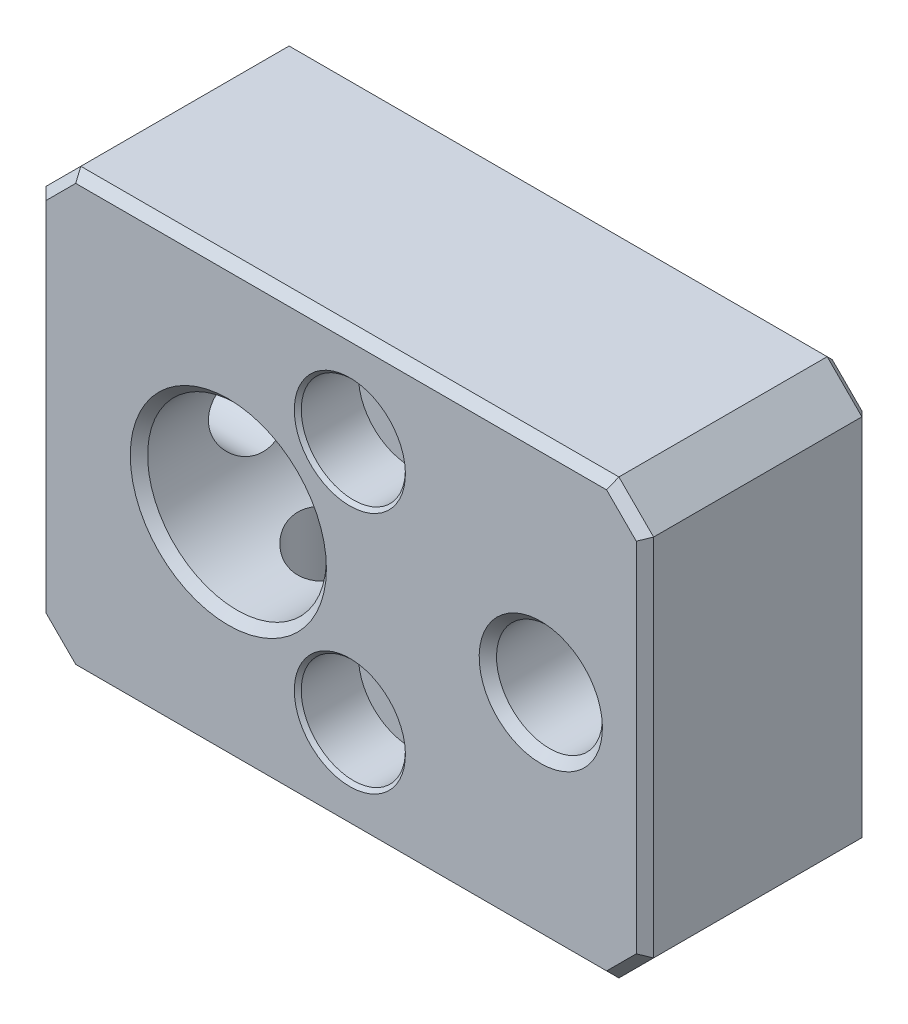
ISO-10303-21;
HEADER;
FILE_DESCRIPTION(('STEP AP214'),'2;1');
FILE_NAME('part.step','',(''),(''),'','','');
FILE_SCHEMA(('AUTOMOTIVE_DESIGN { 1 0 10303 214 1 1 1 1 }'));
ENDSEC;
DATA;
#1=APPLICATION_CONTEXT('core data for automotive mechanical design processes');
#2=APPLICATION_PROTOCOL_DEFINITION('international standard','automotive_design',2000,#1);
#3=PRODUCT_CONTEXT('',#1,'mechanical');
#4=PRODUCT('Part','Part','',(#3));
#5=PRODUCT_RELATED_PRODUCT_CATEGORY('part','',(#4));
#6=PRODUCT_DEFINITION_FORMATION('','',#4);
#7=PRODUCT_DEFINITION_CONTEXT('part definition',#1,'design');
#8=PRODUCT_DEFINITION('design','',#6,#7);
#9=PRODUCT_DEFINITION_SHAPE('','',#8);
#10=(LENGTH_UNIT() NAMED_UNIT(*) SI_UNIT(.MILLI.,.METRE.));
#11=(NAMED_UNIT(*) PLANE_ANGLE_UNIT() SI_UNIT($,.RADIAN.));
#12=(NAMED_UNIT(*) SI_UNIT($,.STERADIAN.) SOLID_ANGLE_UNIT());
#13=UNCERTAINTY_MEASURE_WITH_UNIT(LENGTH_MEASURE(1.E-05),#10,'distance_accuracy_value','');
#14=(GEOMETRIC_REPRESENTATION_CONTEXT(3) GLOBAL_UNCERTAINTY_ASSIGNED_CONTEXT((#13)) GLOBAL_UNIT_ASSIGNED_CONTEXT((#10,
#11,#12)) REPRESENTATION_CONTEXT('',''));
#15=CARTESIAN_POINT('',(0.,0.,0.));
#16=DIRECTION('',(0.,0.,1.));
#17=DIRECTION('',(1.,0.,0.));
#18=AXIS2_PLACEMENT_3D('',#15,#16,#17);
#19=CARTESIAN_POINT('',(7.,7.,13.));
#20=DIRECTION('',(0.,0.,1.));
#21=DIRECTION('',(0.,-1.,0.));
#22=AXIS2_PLACEMENT_3D('',#19,#20,#21);
#23=CYLINDRICAL_SURFACE('',#22,1.7);
#24=CARTESIAN_POINT('',(7.,7.,9.5));
#25=DIRECTION('',(0.,0.,1.));
#26=DIRECTION('',(0.,-1.,0.));
#27=AXIS2_PLACEMENT_3D('',#24,#25,#26);
#28=CIRCLE('',#27,1.7);
#29=CARTESIAN_POINT('',(7.,5.3,9.5));
#30=VERTEX_POINT('',#29);
#31=EDGE_CURVE('E572',#30,#30,#28,.T.);
#32=ORIENTED_EDGE('',*,*,#31,.T.);
#33=EDGE_LOOP('',(#32));
#34=FACE_BOUND('',#33,.T.);
#35=CARTESIAN_POINT('',(7.,7.,3.5));
#36=DIRECTION('',(0.,0.,-1.));
#37=DIRECTION('',(0.,1.,0.));
#38=AXIS2_PLACEMENT_3D('',#35,#36,#37);
#39=CIRCLE('',#38,1.7);
#40=CARTESIAN_POINT('',(7.,8.7,3.5));
#41=VERTEX_POINT('',#40);
#42=EDGE_CURVE('E265',#41,#41,#39,.F.);
#43=ORIENTED_EDGE('',*,*,#42,.F.);
#44=EDGE_LOOP('',(#43));
#45=FACE_BOUND('',#44,.T.);
#46=ADVANCED_FACE('F14',(#34,#45),#23,.F.);
#47=CARTESIAN_POINT('',(7.,-7.,13.));
#48=DIRECTION('',(0.,0.,1.));
#49=DIRECTION('',(0.,-1.,0.));
#50=AXIS2_PLACEMENT_3D('',#47,#48,#49);
#51=CYLINDRICAL_SURFACE('',#50,1.7);
#52=CARTESIAN_POINT('',(7.,-7.,9.5));
#53=DIRECTION('',(0.,0.,1.));
#54=DIRECTION('',(0.,-1.,0.));
#55=AXIS2_PLACEMENT_3D('',#52,#53,#54);
#56=CIRCLE('',#55,1.7);
#57=CARTESIAN_POINT('',(7.,-8.7,9.5));
#58=VERTEX_POINT('',#57);
#59=EDGE_CURVE('E392',#58,#58,#56,.T.);
#60=ORIENTED_EDGE('',*,*,#59,.T.);
#61=EDGE_LOOP('',(#60));
#62=FACE_BOUND('',#61,.T.);
#63=CARTESIAN_POINT('',(7.,-7.,3.5));
#64=DIRECTION('',(0.,0.,-1.));
#65=DIRECTION('',(0.,1.,0.));
#66=AXIS2_PLACEMENT_3D('',#63,#64,#65);
#67=CIRCLE('',#66,1.7);
#68=CARTESIAN_POINT('',(7.,-5.3,3.5));
#69=VERTEX_POINT('',#68);
#70=EDGE_CURVE('E260',#69,#69,#67,.F.);
#71=ORIENTED_EDGE('',*,*,#70,.F.);
#72=EDGE_LOOP('',(#71));
#73=FACE_BOUND('',#72,.T.);
#74=ADVANCED_FACE('F365',(#62,#73),#51,.F.);
#75=CARTESIAN_POINT('',(-11.,-12.5,13.));
#76=DIRECTION('',(0.,1.,0.));
#77=DIRECTION('',(0.,0.,1.));
#78=AXIS2_PLACEMENT_3D('',#75,#76,#77);
#79=PLANE('',#78);
#80=DIRECTION('',(0.,0.,-1.));
#81=VECTOR('',#80,1.);
#82=CARTESIAN_POINT('',(-9.,-12.5,13.));
#83=LINE('',#82,#81);
#84=CARTESIAN_POINT('',(-9.,-12.5,12.5));
#85=VERTEX_POINT('',#84);
#86=CARTESIAN_POINT('',(-9.,-12.5,0.5));
#87=VERTEX_POINT('',#86);
#88=EDGE_CURVE('E426',#85,#87,#83,.T.);
#89=ORIENTED_EDGE('',*,*,#88,.T.);
#90=DIRECTION('',(1.,0.,0.));
#91=VECTOR('',#90,1.);
#92=CARTESIAN_POINT('',(22.,-12.5,0.5));
#93=LINE('',#92,#91);
#94=CARTESIAN_POINT('',(22.,-12.5,0.5));
#95=VERTEX_POINT('',#94);
#96=EDGE_CURVE('E189',#87,#95,#93,.T.);
#97=ORIENTED_EDGE('',*,*,#96,.T.);
#98=DIRECTION('',(0.,0.,1.));
#99=VECTOR('',#98,1.);
#100=CARTESIAN_POINT('',(22.,-12.5,13.));
#101=LINE('',#100,#99);
#102=CARTESIAN_POINT('',(22.,-12.5,12.5));
#103=VERTEX_POINT('',#102);
#104=EDGE_CURVE('E429',#95,#103,#101,.T.);
#105=ORIENTED_EDGE('',*,*,#104,.T.);
#106=DIRECTION('',(-1.,0.,0.));
#107=VECTOR('',#106,1.);
#108=CARTESIAN_POINT('',(-11.,-12.5,12.5));
#109=LINE('',#108,#107);
#110=EDGE_CURVE('E187',#103,#85,#109,.T.);
#111=ORIENTED_EDGE('',*,*,#110,.T.);
#112=EDGE_LOOP('',(#89,#97,#105,#111));
#113=FACE_BOUND('',#112,.T.);
#114=CARTESIAN_POINT('',(0.,-12.5,6.5));
#115=DIRECTION('',(0.,-1.,0.));
#116=DIRECTION('',(0.,0.,-1.));
#117=AXIS2_PLACEMENT_3D('',#114,#115,#116);
#118=CIRCLE('',#117,2.9);
#119=CARTESIAN_POINT('',(0.,-12.5,3.6));
#120=VERTEX_POINT('',#119);
#121=EDGE_CURVE('E241',#120,#120,#118,.T.);
#122=ORIENTED_EDGE('',*,*,#121,.F.);
#123=EDGE_LOOP('',(#122));
#124=FACE_BOUND('',#123,.T.);
#125=ADVANCED_FACE('F379',(#113,#124),#79,.F.);
#126=CARTESIAN_POINT('',(-11.,12.5,13.));
#127=DIRECTION('',(0.,-1.,0.));
#128=DIRECTION('',(0.,0.,-1.));
#129=AXIS2_PLACEMENT_3D('',#126,#127,#128);
#130=PLANE('',#129);
#131=DIRECTION('',(0.,0.,-1.));
#132=VECTOR('',#131,1.);
#133=CARTESIAN_POINT('',(22.,12.5,13.));
#134=LINE('',#133,#132);
#135=CARTESIAN_POINT('',(22.,12.5,12.5));
#136=VERTEX_POINT('',#135);
#137=CARTESIAN_POINT('',(22.,12.5,0.5));
#138=VERTEX_POINT('',#137);
#139=EDGE_CURVE('E417',#136,#138,#134,.T.);
#140=ORIENTED_EDGE('',*,*,#139,.T.);
#141=DIRECTION('',(-1.,0.,0.));
#142=VECTOR('',#141,1.);
#143=CARTESIAN_POINT('',(-9.,12.5,0.5));
#144=LINE('',#143,#142);
#145=CARTESIAN_POINT('',(-9.,12.5,0.5));
#146=VERTEX_POINT('',#145);
#147=EDGE_CURVE('E204',#138,#146,#144,.T.);
#148=ORIENTED_EDGE('',*,*,#147,.T.);
#149=DIRECTION('',(0.,0.,1.));
#150=VECTOR('',#149,1.);
#151=CARTESIAN_POINT('',(-9.,12.5,13.));
#152=LINE('',#151,#150);
#153=CARTESIAN_POINT('',(-9.,12.5,12.5));
#154=VERTEX_POINT('',#153);
#155=EDGE_CURVE('E414',#146,#154,#152,.T.);
#156=ORIENTED_EDGE('',*,*,#155,.T.);
#157=DIRECTION('',(1.,0.,0.));
#158=VECTOR('',#157,1.);
#159=CARTESIAN_POINT('',(-11.,12.5,12.5));
#160=LINE('',#159,#158);
#161=EDGE_CURVE('E202',#154,#136,#160,.T.);
#162=ORIENTED_EDGE('',*,*,#161,.T.);
#163=EDGE_LOOP('',(#140,#148,#156,#162));
#164=FACE_BOUND('',#163,.T.);
#165=ADVANCED_FACE('F386',(#164),#130,.F.);
#166=CARTESIAN_POINT('',(-11.,12.5,13.));
#167=DIRECTION('',(1.,0.,0.));
#168=DIRECTION('',(0.,0.,1.));
#169=AXIS2_PLACEMENT_3D('',#166,#167,#168);
#170=PLANE('',#169);
#171=CARTESIAN_POINT('',(-11.,0.,6.5));
#172=DIRECTION('',(-1.,0.,0.));
#173=DIRECTION('',(0.,0.,-1.));
#174=AXIS2_PLACEMENT_3D('',#171,#172,#173);
#175=CIRCLE('',#174,2.9);
#176=CARTESIAN_POINT('',(-11.,0.,3.6));
#177=VERTEX_POINT('',#176);
#178=EDGE_CURVE('E263',#177,#177,#175,.T.);
#179=ORIENTED_EDGE('',*,*,#178,.F.);
#180=EDGE_LOOP('',(#179));
#181=FACE_BOUND('',#180,.T.);
#182=DIRECTION('',(0.,0.,-1.));
#183=VECTOR('',#182,1.);
#184=CARTESIAN_POINT('',(-11.,10.5,13.));
#185=LINE('',#184,#183);
#186=CARTESIAN_POINT('',(-11.,10.5,12.5));
#187=VERTEX_POINT('',#186);
#188=CARTESIAN_POINT('',(-11.,10.5,0.5));
#189=VERTEX_POINT('',#188);
#190=EDGE_CURVE('E158',#187,#189,#185,.T.);
#191=ORIENTED_EDGE('',*,*,#190,.T.);
#192=DIRECTION('',(0.,-1.,0.));
#193=VECTOR('',#192,1.);
#194=CARTESIAN_POINT('',(-11.,-10.5,0.5));
#195=LINE('',#194,#193);
#196=CARTESIAN_POINT('',(-11.,-10.5,0.5));
#197=VERTEX_POINT('',#196);
#198=EDGE_CURVE('E197',#189,#197,#195,.T.);
#199=ORIENTED_EDGE('',*,*,#198,.T.);
#200=DIRECTION('',(0.,0.,1.));
#201=VECTOR('',#200,1.);
#202=CARTESIAN_POINT('',(-11.,-10.5,13.));
#203=LINE('',#202,#201);
#204=CARTESIAN_POINT('',(-11.,-10.5,12.5));
#205=VERTEX_POINT('',#204);
#206=EDGE_CURVE('E155',#197,#205,#203,.T.);
#207=ORIENTED_EDGE('',*,*,#206,.T.);
#208=DIRECTION('',(0.,1.,0.));
#209=VECTOR('',#208,1.);
#210=CARTESIAN_POINT('',(-11.,12.5,12.5));
#211=LINE('',#210,#209);
#212=EDGE_CURVE('E195',#205,#187,#211,.T.);
#213=ORIENTED_EDGE('',*,*,#212,.T.);
#214=EDGE_LOOP('',(#191,#199,#207,#213));
#215=FACE_BOUND('',#214,.T.);
#216=ADVANCED_FACE('F435',(#181,#215),#170,.F.);
#217=CARTESIAN_POINT('',(24.,12.5,13.));
#218=DIRECTION('',(-1.,0.,0.));
#219=DIRECTION('',(0.,0.,-1.));
#220=AXIS2_PLACEMENT_3D('',#217,#218,#219);
#221=PLANE('',#220);
#222=DIRECTION('',(0.,0.,-1.));
#223=VECTOR('',#222,1.);
#224=CARTESIAN_POINT('',(24.,-10.5,13.));
#225=LINE('',#224,#223);
#226=CARTESIAN_POINT('',(24.,-10.5,12.5));
#227=VERTEX_POINT('',#226);
#228=CARTESIAN_POINT('',(24.,-10.5,0.5));
#229=VERTEX_POINT('',#228);
#230=EDGE_CURVE('E420',#227,#229,#225,.T.);
#231=ORIENTED_EDGE('',*,*,#230,.T.);
#232=DIRECTION('',(0.,1.,0.));
#233=VECTOR('',#232,1.);
#234=CARTESIAN_POINT('',(24.,10.5,0.5));
#235=LINE('',#234,#233);
#236=CARTESIAN_POINT('',(24.,10.5,0.5));
#237=VERTEX_POINT('',#236);
#238=EDGE_CURVE('E181',#229,#237,#235,.T.);
#239=ORIENTED_EDGE('',*,*,#238,.T.);
#240=DIRECTION('',(0.,0.,1.));
#241=VECTOR('',#240,1.);
#242=CARTESIAN_POINT('',(24.,10.5,13.));
#243=LINE('',#242,#241);
#244=CARTESIAN_POINT('',(24.,10.5,12.5));
#245=VERTEX_POINT('',#244);
#246=EDGE_CURVE('E423',#237,#245,#243,.T.);
#247=ORIENTED_EDGE('',*,*,#246,.T.);
#248=DIRECTION('',(0.,-1.,0.));
#249=VECTOR('',#248,1.);
#250=CARTESIAN_POINT('',(24.,12.5,12.5));
#251=LINE('',#250,#249);
#252=EDGE_CURVE('E179',#245,#227,#251,.T.);
#253=ORIENTED_EDGE('',*,*,#252,.T.);
#254=EDGE_LOOP('',(#231,#239,#247,#253));
#255=FACE_BOUND('',#254,.T.);
#256=ADVANCED_FACE('F585',(#255),#221,.F.);
#257=CARTESIAN_POINT('',(24.,12.5,13.));
#258=DIRECTION('',(0.,0.,-1.));
#259=DIRECTION('',(0.,1.,0.));
#260=AXIS2_PLACEMENT_3D('',#257,#258,#259);
#261=PLANE('',#260);
#262=CARTESIAN_POINT('',(18.,0.,13.));
#263=DIRECTION('',(0.,0.,1.));
#264=DIRECTION('',(0.,-1.,0.));
#265=AXIS2_PLACEMENT_3D('',#262,#263,#264);
#266=CIRCLE('',#265,3.55);
#267=CARTESIAN_POINT('',(18.,-3.55,13.));
#268=VERTEX_POINT('',#267);
#269=EDGE_CURVE('E944',#268,#268,#266,.T.);
#270=ORIENTED_EDGE('',*,*,#269,.F.);
#271=EDGE_LOOP('',(#270));
#272=FACE_BOUND('',#271,.T.);
#273=DIRECTION('',(0.,1.,0.));
#274=VECTOR('',#273,1.);
#275=CARTESIAN_POINT('',(23.5,12.5,13.));
#276=LINE('',#275,#274);
#277=CARTESIAN_POINT('',(23.5,-10.2928932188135,13.));
#278=VERTEX_POINT('',#277);
#279=CARTESIAN_POINT('',(23.5,10.2928932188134,13.));
#280=VERTEX_POINT('',#279);
#281=EDGE_CURVE('E31',#278,#280,#276,.T.);
#282=ORIENTED_EDGE('',*,*,#281,.T.);
#283=DIRECTION('',(-0.707106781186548,0.707106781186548,0.));
#284=VECTOR('',#283,1.);
#285=CARTESIAN_POINT('',(21.6464466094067,12.1464466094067,13.));
#286=LINE('',#285,#284);
#287=CARTESIAN_POINT('',(21.7928932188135,12.,13.));
#288=VERTEX_POINT('',#287);
#289=EDGE_CURVE('E218',#280,#288,#286,.T.);
#290=ORIENTED_EDGE('',*,*,#289,.T.);
#291=DIRECTION('',(-1.,0.,0.));
#292=VECTOR('',#291,1.);
#293=CARTESIAN_POINT('',(24.,12.,13.));
#294=LINE('',#293,#292);
#295=CARTESIAN_POINT('',(-8.79289321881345,12.,13.));
#296=VERTEX_POINT('',#295);
#297=EDGE_CURVE('E206',#288,#296,#294,.T.);
#298=ORIENTED_EDGE('',*,*,#297,.T.);
#299=DIRECTION('',(-0.707106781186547,-0.707106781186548,0.));
#300=VECTOR('',#299,1.);
#301=CARTESIAN_POINT('',(-10.6464466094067,10.1464466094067,13.));
#302=LINE('',#301,#300);
#303=CARTESIAN_POINT('',(-10.5,10.2928932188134,13.));
#304=VERTEX_POINT('',#303);
#305=EDGE_CURVE('E208',#296,#304,#302,.T.);
#306=ORIENTED_EDGE('',*,*,#305,.T.);
#307=DIRECTION('',(0.,-1.,0.));
#308=VECTOR('',#307,1.);
#309=CARTESIAN_POINT('',(-10.5,12.5,13.));
#310=LINE('',#309,#308);
#311=CARTESIAN_POINT('',(-10.5,-10.2928932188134,13.));
#312=VERTEX_POINT('',#311);
#313=EDGE_CURVE('E210',#304,#312,#310,.T.);
#314=ORIENTED_EDGE('',*,*,#313,.T.);
#315=DIRECTION('',(0.707106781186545,-0.70710678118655,0.));
#316=VECTOR('',#315,1.);
#317=CARTESIAN_POINT('',(-8.64644660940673,-12.1464466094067,13.));
#318=LINE('',#317,#316);
#319=CARTESIAN_POINT('',(-8.79289321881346,-12.,13.));
#320=VERTEX_POINT('',#319);
#321=EDGE_CURVE('E212',#312,#320,#318,.T.);
#322=ORIENTED_EDGE('',*,*,#321,.T.);
#323=DIRECTION('',(1.,0.,0.));
#324=VECTOR('',#323,1.);
#325=CARTESIAN_POINT('',(24.,-12.,13.));
#326=LINE('',#325,#324);
#327=CARTESIAN_POINT('',(21.7928932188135,-12.,13.));
#328=VERTEX_POINT('',#327);
#329=EDGE_CURVE('E214',#320,#328,#326,.T.);
#330=ORIENTED_EDGE('',*,*,#329,.T.);
#331=DIRECTION('',(0.707106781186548,0.707106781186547,0.));
#332=VECTOR('',#331,1.);
#333=CARTESIAN_POINT('',(23.6464466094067,-10.1464466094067,13.));
#334=LINE('',#333,#332);
#335=EDGE_CURVE('E36',#328,#278,#334,.T.);
#336=ORIENTED_EDGE('',*,*,#335,.T.);
#337=EDGE_LOOP('',(#282,#290,#298,#306,#314,#322,#330,#336));
#338=FACE_BOUND('',#337,.T.);
#339=CARTESIAN_POINT('',(7.,7.,13.));
#340=DIRECTION('',(0.,0.,1.));
#341=DIRECTION('',(0.,-1.,0.));
#342=AXIS2_PLACEMENT_3D('',#339,#340,#341);
#343=CIRCLE('',#342,3.2);
#344=CARTESIAN_POINT('',(7.,3.8,13.));
#345=VERTEX_POINT('',#344);
#346=EDGE_CURVE('E237',#345,#345,#343,.T.);
#347=ORIENTED_EDGE('',*,*,#346,.F.);
#348=EDGE_LOOP('',(#347));
#349=FACE_BOUND('',#348,.T.);
#350=CARTESIAN_POINT('',(7.,-7.,13.));
#351=DIRECTION('',(0.,0.,1.));
#352=DIRECTION('',(0.,-1.,0.));
#353=AXIS2_PLACEMENT_3D('',#350,#351,#352);
#354=CIRCLE('',#353,3.2);
#355=CARTESIAN_POINT('',(7.,-10.2,13.));
#356=VERTEX_POINT('',#355);
#357=EDGE_CURVE('E575',#356,#356,#354,.T.);
#358=ORIENTED_EDGE('',*,*,#357,.F.);
#359=EDGE_LOOP('',(#358));
#360=FACE_BOUND('',#359,.T.);
#361=CARTESIAN_POINT('',(0.,0.,13.));
#362=DIRECTION('',(0.,0.,-1.));
#363=DIRECTION('',(0.,1.,0.));
#364=AXIS2_PLACEMENT_3D('',#361,#362,#363);
#365=CIRCLE('',#364,5.65);
#366=CARTESIAN_POINT('',(0.,5.65,13.));
#367=VERTEX_POINT('',#366);
#368=EDGE_CURVE('E411',#367,#367,#365,.T.);
#369=ORIENTED_EDGE('',*,*,#368,.T.);
#370=EDGE_LOOP('',(#369));
#371=FACE_BOUND('',#370,.T.);
#372=ADVANCED_FACE('F472',(#272,#338,#349,#360,#371),#261,.F.);
#373=CARTESIAN_POINT('',(24.,12.5,0.));
#374=DIRECTION('',(0.,0.,-1.));
#375=DIRECTION('',(0.,1.,0.));
#376=AXIS2_PLACEMENT_3D('',#373,#374,#375);
#377=PLANE('',#376);
#378=CARTESIAN_POINT('',(18.,0.,0.));
#379=DIRECTION('',(0.,0.,1.));
#380=DIRECTION('',(0.,-1.,0.));
#381=AXIS2_PLACEMENT_3D('',#378,#379,#380);
#382=CIRCLE('',#381,3.55);
#383=CARTESIAN_POINT('',(18.,-3.55,0.));
#384=VERTEX_POINT('',#383);
#385=EDGE_CURVE('E282',#384,#384,#382,.T.);
#386=ORIENTED_EDGE('',*,*,#385,.T.);
#387=EDGE_LOOP('',(#386));
#388=FACE_BOUND('',#387,.T.);
#389=CARTESIAN_POINT('',(7.,7.,0.));
#390=DIRECTION('',(0.,0.,-1.));
#391=DIRECTION('',(0.,1.,0.));
#392=AXIS2_PLACEMENT_3D('',#389,#390,#391);
#393=CIRCLE('',#392,3.2);
#394=CARTESIAN_POINT('',(7.,10.2,0.));
#395=VERTEX_POINT('',#394);
#396=EDGE_CURVE('E23',#395,#395,#393,.F.);
#397=ORIENTED_EDGE('',*,*,#396,.T.);
#398=EDGE_LOOP('',(#397));
#399=FACE_BOUND('',#398,.T.);
#400=CARTESIAN_POINT('',(7.,-7.,0.));
#401=DIRECTION('',(0.,0.,-1.));
#402=DIRECTION('',(0.,1.,0.));
#403=AXIS2_PLACEMENT_3D('',#400,#401,#402);
#404=CIRCLE('',#403,3.2);
#405=CARTESIAN_POINT('',(7.,-3.8,0.));
#406=VERTEX_POINT('',#405);
#407=EDGE_CURVE('E271',#406,#406,#404,.F.);
#408=ORIENTED_EDGE('',*,*,#407,.T.);
#409=EDGE_LOOP('',(#408));
#410=FACE_BOUND('',#409,.T.);
#411=DIRECTION('',(1.,0.,0.));
#412=VECTOR('',#411,1.);
#413=CARTESIAN_POINT('',(22.,12.,0.));
#414=LINE('',#413,#412);
#415=CARTESIAN_POINT('',(-8.79289321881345,12.,0.));
#416=VERTEX_POINT('',#415);
#417=CARTESIAN_POINT('',(21.7928932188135,12.,0.));
#418=VERTEX_POINT('',#417);
#419=EDGE_CURVE('E134',#416,#418,#414,.T.);
#420=ORIENTED_EDGE('',*,*,#419,.T.);
#421=DIRECTION('',(0.707106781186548,-0.707106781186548,0.));
#422=VECTOR('',#421,1.);
#423=CARTESIAN_POINT('',(22.6464466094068,11.1464466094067,0.));
#424=LINE('',#423,#422);
#425=CARTESIAN_POINT('',(23.5,10.2928932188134,0.));
#426=VERTEX_POINT('',#425);
#427=EDGE_CURVE('E171',#418,#426,#424,.T.);
#428=ORIENTED_EDGE('',*,*,#427,.T.);
#429=DIRECTION('',(0.,-1.,0.));
#430=VECTOR('',#429,1.);
#431=CARTESIAN_POINT('',(23.5,-10.5,0.));
#432=LINE('',#431,#430);
#433=CARTESIAN_POINT('',(23.5,-10.2928932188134,0.));
#434=VERTEX_POINT('',#433);
#435=EDGE_CURVE('E169',#426,#434,#432,.T.);
#436=ORIENTED_EDGE('',*,*,#435,.T.);
#437=DIRECTION('',(-0.707106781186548,-0.707106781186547,0.));
#438=VECTOR('',#437,1.);
#439=CARTESIAN_POINT('',(35.1464466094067,1.35355339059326,0.));
#440=LINE('',#439,#438);
#441=CARTESIAN_POINT('',(21.7928932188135,-12.,0.));
#442=VERTEX_POINT('',#441);
#443=EDGE_CURVE('E167',#434,#442,#440,.T.);
#444=ORIENTED_EDGE('',*,*,#443,.T.);
#445=DIRECTION('',(-1.,0.,0.));
#446=VECTOR('',#445,1.);
#447=CARTESIAN_POINT('',(-9.,-12.,0.));
#448=LINE('',#447,#446);
#449=CARTESIAN_POINT('',(-8.79289321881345,-12.,0.));
#450=VERTEX_POINT('',#449);
#451=EDGE_CURVE('E165',#442,#450,#448,.T.);
#452=ORIENTED_EDGE('',*,*,#451,.T.);
#453=DIRECTION('',(-0.707106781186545,0.70710678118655,0.));
#454=VECTOR('',#453,1.);
#455=CARTESIAN_POINT('',(-4.64644660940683,-16.1464466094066,0.));
#456=LINE('',#455,#454);
#457=CARTESIAN_POINT('',(-10.5,-10.2928932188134,0.));
#458=VERTEX_POINT('',#457);
#459=EDGE_CURVE('E163',#450,#458,#456,.T.);
#460=ORIENTED_EDGE('',*,*,#459,.T.);
#461=DIRECTION('',(0.,1.,0.));
#462=VECTOR('',#461,1.);
#463=CARTESIAN_POINT('',(-10.5,10.5,0.));
#464=LINE('',#463,#462);
#465=CARTESIAN_POINT('',(-10.5,10.2928932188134,0.));
#466=VERTEX_POINT('',#465);
#467=EDGE_CURVE('E137',#458,#466,#464,.T.);
#468=ORIENTED_EDGE('',*,*,#467,.T.);
#469=DIRECTION('',(0.707106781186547,0.707106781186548,0.));
#470=VECTOR('',#469,1.);
#471=CARTESIAN_POINT('',(7.85355339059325,28.6464466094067,0.));
#472=LINE('',#471,#470);
#473=EDGE_CURVE('E128',#466,#416,#472,.T.);
#474=ORIENTED_EDGE('',*,*,#473,.T.);
#475=EDGE_LOOP('',(#420,#428,#436,#444,#452,#460,#468,#474));
#476=FACE_BOUND('',#475,.T.);
#477=CARTESIAN_POINT('',(0.,0.,0.));
#478=DIRECTION('',(0.,0.,-1.));
#479=DIRECTION('',(0.,1.,0.));
#480=AXIS2_PLACEMENT_3D('',#477,#478,#479);
#481=CIRCLE('',#480,5.65);
#482=CARTESIAN_POINT('',(0.,5.65,0.));
#483=VERTEX_POINT('',#482);
#484=EDGE_CURVE('E395',#483,#483,#481,.F.);
#485=ORIENTED_EDGE('',*,*,#484,.T.);
#486=EDGE_LOOP('',(#485));
#487=FACE_BOUND('',#486,.T.);
#488=ADVANCED_FACE('F130',(#388,#399,#410,#476,#487),#377,.T.);
#489=CARTESIAN_POINT('',(0.,0.,0.));
#490=DIRECTION('',(0.,0.,1.));
#491=DIRECTION('',(0.,-1.,0.));
#492=AXIS2_PLACEMENT_3D('',#489,#490,#491);
#493=CYLINDRICAL_SURFACE('',#492,5.15);
#494=CARTESIAN_POINT('',(-5.15,0.,4.));
#495=CARTESIAN_POINT('',(-5.14999228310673,-0.131881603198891,4.00000917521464));
#496=CARTESIAN_POINT('',(-5.14487865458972,-0.263939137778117,4.01049790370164));
#497=CARTESIAN_POINT('',(-5.12492528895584,-0.524177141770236,4.05200546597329));
#498=CARTESIAN_POINT('',(-5.11006569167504,-0.652349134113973,4.08306622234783));
#499=CARTESIAN_POINT('',(-5.07218287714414,-0.900652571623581,4.16423076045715));
#500=CARTESIAN_POINT('',(-5.0491907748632,-1.02081261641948,4.21426201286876));
#501=CARTESIAN_POINT('',(-4.99717488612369,-1.25086891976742,4.33158677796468));
#502=CARTESIAN_POINT('',(-4.96815180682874,-1.36076637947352,4.39887826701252));
#503=CARTESIAN_POINT('',(-4.90479770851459,-1.57434986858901,4.55326454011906));
#504=CARTESIAN_POINT('',(-4.87025648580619,-1.67730616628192,4.64128140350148));
#505=CARTESIAN_POINT('',(-4.80048320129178,-1.86766124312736,4.83264342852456));
#506=CARTESIAN_POINT('',(-4.76525066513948,-1.95504889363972,4.935999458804));
#507=CARTESIAN_POINT('',(-4.69517534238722,-2.11807993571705,5.16404965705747));
#508=CARTESIAN_POINT('',(-4.66054325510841,-2.19242475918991,5.28974436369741));
#509=CARTESIAN_POINT('',(-4.59907929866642,-2.31860506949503,5.55372835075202));
#510=CARTESIAN_POINT('',(-4.5722421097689,-2.37045591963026,5.69200895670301));
#511=CARTESIAN_POINT('',(-4.53176091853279,-2.4469222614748,5.96898270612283));
#512=CARTESIAN_POINT('',(-4.5174395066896,-2.47294820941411,6.10718267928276));
#513=CARTESIAN_POINT('',(-4.50177252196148,-2.50136725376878,6.38666937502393));
#514=CARTESIAN_POINT('',(-4.500415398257,-2.50378138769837,6.52795323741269));
#515=CARTESIAN_POINT('',(-4.51027949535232,-2.4859469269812,6.7927438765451));
#516=CARTESIAN_POINT('',(-4.52011999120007,-2.46818640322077,6.91648176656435));
#517=CARTESIAN_POINT('',(-4.54886687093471,-2.41479192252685,7.15893567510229));
#518=CARTESIAN_POINT('',(-4.56777587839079,-2.37915279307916,7.27765022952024));
#519=CARTESIAN_POINT('',(-4.61295781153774,-2.29033640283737,7.51005204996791));
#520=CARTESIAN_POINT('',(-4.63939208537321,-2.23676976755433,7.62355767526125));
#521=CARTESIAN_POINT('',(-4.69664428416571,-2.11391120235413,7.8404989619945));
#522=CARTESIAN_POINT('',(-4.72746416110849,-2.04461226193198,7.94393010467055));
#523=CARTESIAN_POINT('',(-4.79443837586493,-1.88265969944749,8.15070235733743));
#524=CARTESIAN_POINT('',(-4.83079184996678,-1.78821089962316,8.25257768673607));
#525=CARTESIAN_POINT('',(-4.9017523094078,-1.58337391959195,8.43963246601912));
#526=CARTESIAN_POINT('',(-4.93635854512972,-1.47297897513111,8.52480479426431));
#527=CARTESIAN_POINT('',(-5.00168436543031,-1.23355506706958,8.6793247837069));
#528=CARTESIAN_POINT('',(-5.0321834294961,-1.10394344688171,8.74787030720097));
#529=CARTESIAN_POINT('',(-5.08402092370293,-0.833170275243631,8.86164056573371));
#530=CARTESIAN_POINT('',(-5.10536622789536,-0.692017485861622,8.90688280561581));
#531=CARTESIAN_POINT('',(-5.13506246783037,-0.41421586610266,8.96922075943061));
#532=CARTESIAN_POINT('',(-5.14431206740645,-0.278102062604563,8.98826931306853));
#533=CARTESIAN_POINT('',(-5.15181539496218,-0.00431483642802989,9.00374838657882));
#534=CARTESIAN_POINT('',(-5.15007389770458,0.133357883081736,9.00018872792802));
#535=CARTESIAN_POINT('',(-5.13632800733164,0.395817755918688,8.97173919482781));
#536=CARTESIAN_POINT('',(-5.12507265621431,0.520818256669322,8.94840580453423));
#537=CARTESIAN_POINT('',(-5.09436620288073,0.764899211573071,8.88346035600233));
#538=CARTESIAN_POINT('',(-5.07491417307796,0.883978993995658,8.84184622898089));
#539=CARTESIAN_POINT('',(-5.02887095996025,1.11690549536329,8.74034490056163));
#540=CARTESIAN_POINT('',(-5.00208503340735,1.23049202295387,8.67995204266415));
#541=CARTESIAN_POINT('',(-4.94400659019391,1.44630857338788,8.54316748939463));
#542=CARTESIAN_POINT('',(-4.91271211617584,1.54853362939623,8.46676883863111));
#543=CARTESIAN_POINT('',(-4.84521786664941,1.74887318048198,8.29185456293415));
#544=CARTESIAN_POINT('',(-4.80883326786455,1.84570385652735,8.19193694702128));
#545=CARTESIAN_POINT('',(-4.73751101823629,2.02176441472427,7.97708327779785));
#546=CARTESIAN_POINT('',(-4.70257423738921,2.10098383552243,7.86213836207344));
#547=CARTESIAN_POINT('',(-4.63677651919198,2.24257904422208,7.61445066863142));
#548=CARTESIAN_POINT('',(-4.60614184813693,2.30412963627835,7.48117088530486));
#549=CARTESIAN_POINT('',(-4.5552099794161,2.40327225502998,7.20416812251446));
#550=CARTESIAN_POINT('',(-4.53490025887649,2.44089331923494,7.06045803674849));
#551=CARTESIAN_POINT('',(-4.50932954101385,2.48778940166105,6.78113577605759));
#552=CARTESIAN_POINT('',(-4.50283530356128,2.49939296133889,6.64602905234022));
#553=CARTESIAN_POINT('',(-4.50218955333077,2.50055977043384,6.37571245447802));
#554=CARTESIAN_POINT('',(-4.50803362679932,2.4901309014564,6.24050263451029));
#555=CARTESIAN_POINT('',(-4.53012716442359,2.44967278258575,5.98589221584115));
#556=CARTESIAN_POINT('',(-4.54544986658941,2.42138506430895,5.86612477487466));
#557=CARTESIAN_POINT('',(-4.58374659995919,2.3480773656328,5.63313269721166));
#558=CARTESIAN_POINT('',(-4.60672299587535,2.30305221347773,5.51991009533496));
#559=CARTESIAN_POINT('',(-4.65962989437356,2.19413774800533,5.29483266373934));
#560=CARTESIAN_POINT('',(-4.68992380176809,2.12918459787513,5.1835803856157));
#561=CARTESIAN_POINT('',(-4.75337663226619,1.98348812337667,4.97284385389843));
#562=CARTESIAN_POINT('',(-4.78653698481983,1.90273689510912,4.87336553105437));
#563=CARTESIAN_POINT('',(-4.8564350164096,1.71709688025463,4.6774309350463));
#564=CARTESIAN_POINT('',(-4.89315737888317,1.61051760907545,4.58256107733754));
#565=CARTESIAN_POINT('',(-4.96257901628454,1.38188279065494,4.41175048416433));
#566=CARTESIAN_POINT('',(-4.99527625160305,1.25981946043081,4.33581932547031));
#567=CARTESIAN_POINT('',(-5.05315202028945,1.00272094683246,4.20537917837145));
#568=CARTESIAN_POINT('',(-5.07832222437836,0.86767161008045,4.15089390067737));
#569=CARTESIAN_POINT('',(-5.10817447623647,0.658813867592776,4.08726763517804));
#570=CARTESIAN_POINT('',(-5.11680459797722,0.58820162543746,4.06908256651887));
#571=CARTESIAN_POINT('',(-5.13120411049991,0.445392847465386,4.03891554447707));
#572=CARTESIAN_POINT('',(-5.13697531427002,0.373197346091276,4.0269296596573));
#573=CARTESIAN_POINT('',(-5.144134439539,0.250744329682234,4.01210017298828));
#574=CARTESIAN_POINT('',(-5.14633015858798,0.200730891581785,4.00756666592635));
#575=CARTESIAN_POINT('',(-5.14926442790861,0.100486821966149,4.00151479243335));
#576=CARTESIAN_POINT('',(-5.15000294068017,0.0502561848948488,3.99999650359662));
#577=CARTESIAN_POINT('',(-5.15,0.,4.));
#578=B_SPLINE_CURVE_WITH_KNOTS('',3,(#494,#495,#496,#497,#498,#499,#500,#501,#502,#503,#504,
#505,#506,#507,#508,#509,#510,#511,#512,#513,#514,#515,#516,#517,#518,#519,#520,#521,#522,#523,
#524,#525,#526,#527,#528,#529,#530,#531,#532,#533,#534,#535,#536,#537,#538,#539,#540,#541,#542,
#543,#544,#545,#546,#547,#548,#549,#550,#551,#552,#553,#554,#555,#556,#557,#558,#559,#560,#561,
#562,#563,#564,#565,#566,#567,#568,#569,#570,#571,#572,#573,#574,#575,#576,#577),.UNSPECIFIED.,
.T.,.F.,(4,2,2,2,2,2,2,2,2,2,2,2,2,2,2,2,2,2,2,2,2,2,2,2,2,2,2,2,2,2,2,2,2,2,2,2,2,2,2,2,2,4),
(0.,0.395449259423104,0.791706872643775,1.1864645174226,1.58117590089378,1.99877583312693,
2.41667308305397,2.86465831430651,3.31233708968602,3.73394005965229,4.15516735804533,
4.52959554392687,4.90413211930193,5.2873973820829,5.67083376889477,6.09974951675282,
6.52884774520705,6.97572966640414,7.42227540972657,7.83329661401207,8.24413927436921,
8.62535884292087,9.0066215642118,9.39919943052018,9.79194824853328,10.2215171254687,
10.6513404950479,11.0988131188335,11.5457417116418,11.9507339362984,12.3555813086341,
12.7260138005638,13.0965608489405,13.4919939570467,13.887625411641,14.3275689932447,
14.7677345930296,15.2083854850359,15.4283872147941,15.6482492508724,15.798939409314,
15.9496334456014),.UNSPECIFIED.);
#579=CARTESIAN_POINT('',(-5.15,0.,4.));
#580=VERTEX_POINT('',#579);
#581=EDGE_CURVE('E278',#580,#580,#578,.T.);
#582=ORIENTED_EDGE('',*,*,#581,.T.);
#583=EDGE_LOOP('',(#582));
#584=FACE_BOUND('',#583,.T.);
#585=CARTESIAN_POINT('',(0.,-5.15,4.));
#586=CARTESIAN_POINT('',(0.131881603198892,-5.14999228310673,4.00000917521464));
#587=CARTESIAN_POINT('',(0.263939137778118,-5.14487865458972,4.01049790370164));
#588=CARTESIAN_POINT('',(0.524177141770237,-5.12492528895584,4.05200546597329));
#589=CARTESIAN_POINT('',(0.652349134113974,-5.11006569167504,4.08306622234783));
#590=CARTESIAN_POINT('',(0.900652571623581,-5.07218287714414,4.16423076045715));
#591=CARTESIAN_POINT('',(1.02081261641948,-5.0491907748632,4.21426201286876));
#592=CARTESIAN_POINT('',(1.25086891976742,-4.99717488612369,4.33158677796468));
#593=CARTESIAN_POINT('',(1.36076637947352,-4.96815180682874,4.39887826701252));
#594=CARTESIAN_POINT('',(1.57434986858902,-4.90479770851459,4.55326454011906));
#595=CARTESIAN_POINT('',(1.67730616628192,-4.87025648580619,4.64128140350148));
#596=CARTESIAN_POINT('',(1.86766124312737,-4.80048320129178,4.83264342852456));
#597=CARTESIAN_POINT('',(1.95504889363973,-4.76525066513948,4.935999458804));
#598=CARTESIAN_POINT('',(2.11807993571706,-4.69517534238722,5.16404965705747));
#599=CARTESIAN_POINT('',(2.19242475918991,-4.66054325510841,5.28974436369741));
#600=CARTESIAN_POINT('',(2.31860506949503,-4.59907929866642,5.55372835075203));
#601=CARTESIAN_POINT('',(2.37045591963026,-4.5722421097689,5.69200895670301));
#602=CARTESIAN_POINT('',(2.4469222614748,-4.53176091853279,5.96898270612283));
#603=CARTESIAN_POINT('',(2.47294820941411,-4.5174395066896,6.10718267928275));
#604=CARTESIAN_POINT('',(2.50136725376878,-4.50177252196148,6.38666937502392));
#605=CARTESIAN_POINT('',(2.50378138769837,-4.500415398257,6.52795323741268));
#606=CARTESIAN_POINT('',(2.4859469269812,-4.51027949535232,6.79274387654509));
#607=CARTESIAN_POINT('',(2.46818640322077,-4.52011999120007,6.91648176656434));
#608=CARTESIAN_POINT('',(2.41479192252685,-4.5488668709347,7.15893567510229));
#609=CARTESIAN_POINT('',(2.37915279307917,-4.56777587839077,7.27765022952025));
#610=CARTESIAN_POINT('',(2.29033640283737,-4.61295781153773,7.51005204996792));
#611=CARTESIAN_POINT('',(2.23676976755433,-4.63939208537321,7.62355767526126));
#612=CARTESIAN_POINT('',(2.11391120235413,-4.69664428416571,7.8404989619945));
#613=CARTESIAN_POINT('',(2.04461226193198,-4.72746416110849,7.94393010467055));
#614=CARTESIAN_POINT('',(1.88265969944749,-4.79443837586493,8.15070235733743));
#615=CARTESIAN_POINT('',(1.78821089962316,-4.83079184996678,8.25257768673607));
#616=CARTESIAN_POINT('',(1.58337391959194,-4.9017523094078,8.43963246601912));
#617=CARTESIAN_POINT('',(1.47297897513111,-4.93635854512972,8.52480479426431));
#618=CARTESIAN_POINT('',(1.23355506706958,-5.00168436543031,8.6793247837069));
#619=CARTESIAN_POINT('',(1.10394344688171,-5.0321834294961,8.74787030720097));
#620=CARTESIAN_POINT('',(0.833170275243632,-5.08402092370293,8.86164056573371));
#621=CARTESIAN_POINT('',(0.692017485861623,-5.10536622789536,8.90688280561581));
#622=CARTESIAN_POINT('',(0.414215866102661,-5.13506246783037,8.96922075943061));
#623=CARTESIAN_POINT('',(0.278102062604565,-5.14431206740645,8.98826931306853));
#624=CARTESIAN_POINT('',(0.00431483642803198,-5.15181539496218,9.00374838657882));
#625=CARTESIAN_POINT('',(-0.133357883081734,-5.15007389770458,9.00018872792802));
#626=CARTESIAN_POINT('',(-0.395817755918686,-5.13632800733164,8.97173919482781));
#627=CARTESIAN_POINT('',(-0.520818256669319,-5.12507265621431,8.94840580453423));
#628=CARTESIAN_POINT('',(-0.764899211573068,-5.09436620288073,8.88346035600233));
#629=CARTESIAN_POINT('',(-0.883978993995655,-5.07491417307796,8.84184622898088));
#630=CARTESIAN_POINT('',(-1.11690549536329,-5.02887095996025,8.74034490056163));
#631=CARTESIAN_POINT('',(-1.23049202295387,-5.00208503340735,8.67995204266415));
#632=CARTESIAN_POINT('',(-1.44630857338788,-4.94400659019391,8.54316748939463));
#633=CARTESIAN_POINT('',(-1.54853362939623,-4.91271211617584,8.46676883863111));
#634=CARTESIAN_POINT('',(-1.74887318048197,-4.84521786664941,8.29185456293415));
#635=CARTESIAN_POINT('',(-1.84570385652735,-4.80883326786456,8.19193694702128));
#636=CARTESIAN_POINT('',(-2.02176441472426,-4.73751101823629,7.97708327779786));
#637=CARTESIAN_POINT('',(-2.10098383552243,-4.70257423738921,7.86213836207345));
#638=CARTESIAN_POINT('',(-2.24257904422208,-4.63677651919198,7.61445066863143));
#639=CARTESIAN_POINT('',(-2.30412963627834,-4.60614184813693,7.48117088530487));
#640=CARTESIAN_POINT('',(-2.40327225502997,-4.5552099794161,7.20416812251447));
#641=CARTESIAN_POINT('',(-2.44089331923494,-4.5349002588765,7.0604580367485));
#642=CARTESIAN_POINT('',(-2.48778940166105,-4.50932954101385,6.7811357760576));
#643=CARTESIAN_POINT('',(-2.49939296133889,-4.50283530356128,6.64602905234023));
#644=CARTESIAN_POINT('',(-2.50055977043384,-4.50218955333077,6.37571245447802));
#645=CARTESIAN_POINT('',(-2.4901309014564,-4.50803362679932,6.24050263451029));
#646=CARTESIAN_POINT('',(-2.44967278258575,-4.53012716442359,5.98589221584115));
#647=CARTESIAN_POINT('',(-2.42138506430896,-4.54544986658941,5.86612477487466));
#648=CARTESIAN_POINT('',(-2.3480773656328,-4.58374659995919,5.63313269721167));
#649=CARTESIAN_POINT('',(-2.30305221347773,-4.60672299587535,5.51991009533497));
#650=CARTESIAN_POINT('',(-2.19413774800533,-4.65962989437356,5.29483266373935));
#651=CARTESIAN_POINT('',(-2.12918459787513,-4.68992380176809,5.18358038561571));
#652=CARTESIAN_POINT('',(-1.98348812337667,-4.75337663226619,4.97284385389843));
#653=CARTESIAN_POINT('',(-1.90273689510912,-4.78653698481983,4.87336553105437));
#654=CARTESIAN_POINT('',(-1.71709688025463,-4.8564350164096,4.6774309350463));
#655=CARTESIAN_POINT('',(-1.61051760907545,-4.89315737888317,4.58256107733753));
#656=CARTESIAN_POINT('',(-1.38188279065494,-4.96257901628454,4.41175048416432));
#657=CARTESIAN_POINT('',(-1.25981946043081,-4.99527625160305,4.33581932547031));
#658=CARTESIAN_POINT('',(-1.00272094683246,-5.05315202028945,4.20537917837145));
#659=CARTESIAN_POINT('',(-0.86767161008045,-5.07832222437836,4.15089390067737));
#660=CARTESIAN_POINT('',(-0.658813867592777,-5.10817447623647,4.08726763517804));
#661=CARTESIAN_POINT('',(-0.588201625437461,-5.11680459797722,4.06908256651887));
#662=CARTESIAN_POINT('',(-0.445392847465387,-5.13120411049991,4.03891554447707));
#663=CARTESIAN_POINT('',(-0.373197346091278,-5.13697531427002,4.0269296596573));
#664=CARTESIAN_POINT('',(-0.250744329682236,-5.144134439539,4.01210017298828));
#665=CARTESIAN_POINT('',(-0.200730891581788,-5.14633015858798,4.00756666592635));
#666=CARTESIAN_POINT('',(-0.100486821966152,-5.14926442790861,4.00151479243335));
#667=CARTESIAN_POINT('',(-0.0502561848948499,-5.15000294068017,3.99999650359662));
#668=CARTESIAN_POINT('',(0.,-5.15,4.));
#669=B_SPLINE_CURVE_WITH_KNOTS('',3,(#585,#586,#587,#588,#589,#590,#591,#592,#593,#594,#595,
#596,#597,#598,#599,#600,#601,#602,#603,#604,#605,#606,#607,#608,#609,#610,#611,#612,#613,#614,
#615,#616,#617,#618,#619,#620,#621,#622,#623,#624,#625,#626,#627,#628,#629,#630,#631,#632,#633,
#634,#635,#636,#637,#638,#639,#640,#641,#642,#643,#644,#645,#646,#647,#648,#649,#650,#651,#652,
#653,#654,#655,#656,#657,#658,#659,#660,#661,#662,#663,#664,#665,#666,#667,#668),.UNSPECIFIED.,
.T.,.F.,(4,2,2,2,2,2,2,2,2,2,2,2,2,2,2,2,2,2,2,2,2,2,2,2,2,2,2,2,2,2,2,2,2,2,2,2,2,2,2,2,2,4),
(0.,0.395449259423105,0.791706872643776,1.1864645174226,1.58117590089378,1.99877583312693,
2.41667308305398,2.86465831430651,3.31233708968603,3.73394005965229,4.15516735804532,
4.52959554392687,4.90413211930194,5.28739738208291,5.67083376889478,6.09974951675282,
6.52884774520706,6.97572966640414,7.42227540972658,7.83329661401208,8.24413927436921,
8.62535884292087,9.0066215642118,9.39919943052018,9.79194824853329,10.2215171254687,
10.6513404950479,11.0988131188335,11.5457417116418,11.9507339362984,12.3555813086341,
12.7260138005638,13.0965608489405,13.4919939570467,13.887625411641,14.3275689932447,
14.7677345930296,15.2083854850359,15.4283872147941,15.6482492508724,15.798939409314,
15.9496334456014),.UNSPECIFIED.);
#670=CARTESIAN_POINT('',(0.,-5.15,4.));
#671=VERTEX_POINT('',#670);
#672=EDGE_CURVE('E277',#671,#671,#669,.T.);
#673=ORIENTED_EDGE('',*,*,#672,.T.);
#674=EDGE_LOOP('',(#673));
#675=FACE_BOUND('',#674,.T.);
#676=CARTESIAN_POINT('',(0.,0.,0.499999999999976));
#677=DIRECTION('',(0.,0.,-1.));
#678=DIRECTION('',(0.,1.,0.));
#679=AXIS2_PLACEMENT_3D('',#676,#677,#678);
#680=CIRCLE('',#679,5.15);
#681=CARTESIAN_POINT('',(0.,5.15,0.499999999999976));
#682=VERTEX_POINT('',#681);
#683=EDGE_CURVE('E408',#682,#682,#680,.T.);
#684=ORIENTED_EDGE('',*,*,#683,.T.);
#685=EDGE_LOOP('',(#684));
#686=FACE_BOUND('',#685,.T.);
#687=CARTESIAN_POINT('',(0.,0.,12.5));
#688=DIRECTION('',(0.,0.,-1.));
#689=DIRECTION('',(0.,1.,0.));
#690=AXIS2_PLACEMENT_3D('',#687,#688,#689);
#691=CIRCLE('',#690,5.15);
#692=CARTESIAN_POINT('',(0.,5.15,12.5));
#693=VERTEX_POINT('',#692);
#694=EDGE_CURVE('E399',#693,#693,#691,.F.);
#695=ORIENTED_EDGE('',*,*,#694,.T.);
#696=EDGE_LOOP('',(#695));
#697=FACE_BOUND('',#696,.T.);
#698=ADVANCED_FACE('F299',(#584,#675,#686,#697),#493,.F.);
#699=CARTESIAN_POINT('',(0.,0.,0.));
#700=DIRECTION('',(0.,0.,-1.));
#701=DIRECTION('',(0.,1.,0.));
#702=AXIS2_PLACEMENT_3D('',#699,#700,#701);
#703=CONICAL_SURFACE('',#702,5.65,0.785398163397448);
#704=ORIENTED_EDGE('',*,*,#683,.F.);
#705=EDGE_LOOP('',(#704));
#706=FACE_BOUND('',#705,.T.);
#707=ORIENTED_EDGE('',*,*,#484,.F.);
#708=EDGE_LOOP('',(#707));
#709=FACE_BOUND('',#708,.T.);
#710=ADVANCED_FACE('F591',(#706,#709),#703,.F.);
#711=CARTESIAN_POINT('',(0.,0.,12.5));
#712=DIRECTION('',(0.,0.,1.));
#713=DIRECTION('',(0.,-1.,0.));
#714=AXIS2_PLACEMENT_3D('',#711,#712,#713);
#715=CONICAL_SURFACE('',#714,5.15,0.785398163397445);
#716=ORIENTED_EDGE('',*,*,#368,.F.);
#717=EDGE_LOOP('',(#716));
#718=FACE_BOUND('',#717,.T.);
#719=ORIENTED_EDGE('',*,*,#694,.F.);
#720=EDGE_LOOP('',(#719));
#721=FACE_BOUND('',#720,.T.);
#722=ADVANCED_FACE('F376',(#718,#721),#715,.F.);
#723=CARTESIAN_POINT('',(7.,-10.,9.5));
#724=DIRECTION('',(0.,0.,-1.));
#725=DIRECTION('',(0.,1.,0.));
#726=AXIS2_PLACEMENT_3D('',#723,#724,#725);
#727=PLANE('',#726);
#728=ORIENTED_EDGE('',*,*,#59,.F.);
#729=EDGE_LOOP('',(#728));
#730=FACE_BOUND('',#729,.T.);
#731=CARTESIAN_POINT('',(7.,-7.,9.5));
#732=DIRECTION('',(0.,0.,1.));
#733=DIRECTION('',(0.,-1.,0.));
#734=AXIS2_PLACEMENT_3D('',#731,#732,#733);
#735=CIRCLE('',#734,3.);
#736=CARTESIAN_POINT('',(7.,-10.,9.5));
#737=VERTEX_POINT('',#736);
#738=EDGE_CURVE('E396',#737,#737,#735,.T.);
#739=ORIENTED_EDGE('',*,*,#738,.T.);
#740=EDGE_LOOP('',(#739));
#741=FACE_BOUND('',#740,.T.);
#742=ADVANCED_FACE('F373',(#730,#741),#727,.F.);
#743=CARTESIAN_POINT('',(7.,-7.,13.));
#744=DIRECTION('',(0.,0.,1.));
#745=DIRECTION('',(0.,-1.,0.));
#746=AXIS2_PLACEMENT_3D('',#743,#744,#745);
#747=CYLINDRICAL_SURFACE('',#746,3.);
#748=ORIENTED_EDGE('',*,*,#738,.F.);
#749=EDGE_LOOP('',(#748));
#750=FACE_BOUND('',#749,.T.);
#751=CARTESIAN_POINT('',(7.,-7.,12.8));
#752=DIRECTION('',(0.,0.,1.));
#753=DIRECTION('',(0.,-1.,0.));
#754=AXIS2_PLACEMENT_3D('',#751,#752,#753);
#755=CIRCLE('',#754,3.);
#756=CARTESIAN_POINT('',(7.,-10.,12.8));
#757=VERTEX_POINT('',#756);
#758=EDGE_CURVE('E402',#757,#757,#755,.T.);
#759=ORIENTED_EDGE('',*,*,#758,.T.);
#760=EDGE_LOOP('',(#759));
#761=FACE_BOUND('',#760,.T.);
#762=ADVANCED_FACE('F369',(#750,#761),#747,.F.);
#763=CARTESIAN_POINT('',(7.,-7.,13.));
#764=DIRECTION('',(0.,0.,1.));
#765=DIRECTION('',(0.,-1.,0.));
#766=AXIS2_PLACEMENT_3D('',#763,#764,#765);
#767=CONICAL_SURFACE('',#766,3.2,0.785398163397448);
#768=ORIENTED_EDGE('',*,*,#758,.F.);
#769=EDGE_LOOP('',(#768));
#770=FACE_BOUND('',#769,.T.);
#771=ORIENTED_EDGE('',*,*,#357,.T.);
#772=EDGE_LOOP('',(#771));
#773=FACE_BOUND('',#772,.T.);
#774=ADVANCED_FACE('F361',(#770,#773),#767,.F.);
#775=CARTESIAN_POINT('',(7.,4.,9.5));
#776=DIRECTION('',(0.,0.,-1.));
#777=DIRECTION('',(0.,1.,0.));
#778=AXIS2_PLACEMENT_3D('',#775,#776,#777);
#779=PLANE('',#778);
#780=ORIENTED_EDGE('',*,*,#31,.F.);
#781=EDGE_LOOP('',(#780));
#782=FACE_BOUND('',#781,.T.);
#783=CARTESIAN_POINT('',(7.,7.,9.5));
#784=DIRECTION('',(0.,0.,1.));
#785=DIRECTION('',(0.,-1.,0.));
#786=AXIS2_PLACEMENT_3D('',#783,#784,#785);
#787=CIRCLE('',#786,3.);
#788=CARTESIAN_POINT('',(7.,4.,9.5));
#789=VERTEX_POINT('',#788);
#790=EDGE_CURVE('E569',#789,#789,#787,.T.);
#791=ORIENTED_EDGE('',*,*,#790,.T.);
#792=EDGE_LOOP('',(#791));
#793=FACE_BOUND('',#792,.T.);
#794=ADVANCED_FACE('F357',(#782,#793),#779,.F.);
#795=CARTESIAN_POINT('',(7.,7.,13.));
#796=DIRECTION('',(0.,0.,1.));
#797=DIRECTION('',(0.,-1.,0.));
#798=AXIS2_PLACEMENT_3D('',#795,#796,#797);
#799=CYLINDRICAL_SURFACE('',#798,3.);
#800=ORIENTED_EDGE('',*,*,#790,.F.);
#801=EDGE_LOOP('',(#800));
#802=FACE_BOUND('',#801,.T.);
#803=CARTESIAN_POINT('',(7.,7.,12.8));
#804=DIRECTION('',(0.,0.,1.));
#805=DIRECTION('',(0.,-1.,0.));
#806=AXIS2_PLACEMENT_3D('',#803,#804,#805);
#807=CIRCLE('',#806,3.);
#808=CARTESIAN_POINT('',(7.,4.,12.8));
#809=VERTEX_POINT('',#808);
#810=EDGE_CURVE('E566',#809,#809,#807,.T.);
#811=ORIENTED_EDGE('',*,*,#810,.T.);
#812=EDGE_LOOP('',(#811));
#813=FACE_BOUND('',#812,.T.);
#814=ADVANCED_FACE('F353',(#802,#813),#799,.F.);
#815=CARTESIAN_POINT('',(7.,7.,13.));
#816=DIRECTION('',(0.,0.,1.));
#817=DIRECTION('',(0.,-1.,0.));
#818=AXIS2_PLACEMENT_3D('',#815,#816,#817);
#819=CONICAL_SURFACE('',#818,3.2,0.785398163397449);
#820=ORIENTED_EDGE('',*,*,#810,.F.);
#821=EDGE_LOOP('',(#820));
#822=FACE_BOUND('',#821,.T.);
#823=ORIENTED_EDGE('',*,*,#346,.T.);
#824=EDGE_LOOP('',(#823));
#825=FACE_BOUND('',#824,.T.);
#826=ADVANCED_FACE('F349',(#822,#825),#819,.F.);
#827=CARTESIAN_POINT('',(22.,12.5,13.));
#828=DIRECTION('',(-0.707106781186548,-0.707106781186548,0.));
#829=DIRECTION('',(0.,0.,-1.));
#830=AXIS2_PLACEMENT_3D('',#827,#828,#829);
#831=PLANE('',#830);
#832=ORIENTED_EDGE('',*,*,#246,.F.);
#833=DIRECTION('',(0.707106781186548,-0.707106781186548,0.));
#834=VECTOR('',#833,1.);
#835=CARTESIAN_POINT('',(22.,12.5,0.5));
#836=LINE('',#835,#834);
#837=EDGE_CURVE('E176',#237,#138,#836,.F.);
#838=ORIENTED_EDGE('',*,*,#837,.T.);
#839=ORIENTED_EDGE('',*,*,#139,.F.);
#840=DIRECTION('',(-0.707106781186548,0.707106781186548,0.));
#841=VECTOR('',#840,1.);
#842=CARTESIAN_POINT('',(24.,10.5,12.5));
#843=LINE('',#842,#841);
#844=EDGE_CURVE('E173',#136,#245,#843,.F.);
#845=ORIENTED_EDGE('',*,*,#844,.T.);
#846=EDGE_LOOP('',(#832,#838,#839,#845));
#847=FACE_BOUND('',#846,.T.);
#848=ADVANCED_FACE('F352',(#847),#831,.F.);
#849=CARTESIAN_POINT('',(24.,-10.5,13.));
#850=DIRECTION('',(-0.707106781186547,0.707106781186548,0.));
#851=DIRECTION('',(0.,0.,-1.));
#852=AXIS2_PLACEMENT_3D('',#849,#850,#851);
#853=PLANE('',#852);
#854=ORIENTED_EDGE('',*,*,#104,.F.);
#855=DIRECTION('',(-0.707106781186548,-0.707106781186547,0.));
#856=VECTOR('',#855,1.);
#857=CARTESIAN_POINT('',(24.,-10.5,0.5));
#858=LINE('',#857,#856);
#859=EDGE_CURVE('E185',#95,#229,#858,.F.);
#860=ORIENTED_EDGE('',*,*,#859,.T.);
#861=ORIENTED_EDGE('',*,*,#230,.F.);
#862=DIRECTION('',(0.707106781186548,0.707106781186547,0.));
#863=VECTOR('',#862,1.);
#864=CARTESIAN_POINT('',(22.,-12.5,12.5));
#865=LINE('',#864,#863);
#866=EDGE_CURVE('E183',#227,#103,#865,.F.);
#867=ORIENTED_EDGE('',*,*,#866,.T.);
#868=EDGE_LOOP('',(#854,#860,#861,#867));
#869=FACE_BOUND('',#868,.T.);
#870=ADVANCED_FACE('F628',(#869),#853,.F.);
#871=CARTESIAN_POINT('',(-9.,-12.5,13.));
#872=DIRECTION('',(0.70710678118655,0.707106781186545,0.));
#873=DIRECTION('',(0.,0.,-1.));
#874=AXIS2_PLACEMENT_3D('',#871,#872,#873);
#875=PLANE('',#874);
#876=ORIENTED_EDGE('',*,*,#206,.F.);
#877=DIRECTION('',(-0.707106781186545,0.70710678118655,0.));
#878=VECTOR('',#877,1.);
#879=CARTESIAN_POINT('',(-9.,-12.5,0.5));
#880=LINE('',#879,#878);
#881=EDGE_CURVE('E193',#197,#87,#880,.F.);
#882=ORIENTED_EDGE('',*,*,#881,.T.);
#883=ORIENTED_EDGE('',*,*,#88,.F.);
#884=DIRECTION('',(0.707106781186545,-0.70710678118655,0.));
#885=VECTOR('',#884,1.);
#886=CARTESIAN_POINT('',(-11.,-10.5,12.5));
#887=LINE('',#886,#885);
#888=EDGE_CURVE('E191',#85,#205,#887,.F.);
#889=ORIENTED_EDGE('',*,*,#888,.T.);
#890=EDGE_LOOP('',(#876,#882,#883,#889));
#891=FACE_BOUND('',#890,.T.);
#892=ADVANCED_FACE('F451',(#891),#875,.F.);
#893=CARTESIAN_POINT('',(-11.,10.5,13.));
#894=DIRECTION('',(0.707106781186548,-0.707106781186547,0.));
#895=DIRECTION('',(0.,0.,-1.));
#896=AXIS2_PLACEMENT_3D('',#893,#894,#895);
#897=PLANE('',#896);
#898=ORIENTED_EDGE('',*,*,#155,.F.);
#899=DIRECTION('',(0.707106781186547,0.707106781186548,0.));
#900=VECTOR('',#899,1.);
#901=CARTESIAN_POINT('',(-11.,10.5,0.5));
#902=LINE('',#901,#900);
#903=EDGE_CURVE('E146',#146,#189,#902,.F.);
#904=ORIENTED_EDGE('',*,*,#903,.T.);
#905=ORIENTED_EDGE('',*,*,#190,.F.);
#906=DIRECTION('',(-0.707106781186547,-0.707106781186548,0.));
#907=VECTOR('',#906,1.);
#908=CARTESIAN_POINT('',(-9.,12.5,12.5));
#909=LINE('',#908,#907);
#910=EDGE_CURVE('E199',#187,#154,#909,.F.);
#911=ORIENTED_EDGE('',*,*,#910,.T.);
#912=EDGE_LOOP('',(#898,#904,#905,#911));
#913=FACE_BOUND('',#912,.T.);
#914=ADVANCED_FACE('F518',(#913),#897,.F.);
#915=CARTESIAN_POINT('',(-4.64644660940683,-16.1464466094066,0.));
#916=DIRECTION('',(-0.5,-0.5,-0.70710678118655));
#917=DIRECTION('',(0.707106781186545,-0.70710678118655,0.));
#918=AXIS2_PLACEMENT_3D('',#915,#916,#917);
#919=PLANE('',#918);
#920=DIRECTION('',(-0.281084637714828,-0.678598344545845,0.678598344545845));
#921=VECTOR('',#920,1.);
#922=CARTESIAN_POINT('',(-9.25619641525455,-13.1185128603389,1.11851286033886));
#923=LINE('',#922,#921);
#924=EDGE_CURVE('E231',#87,#450,#923,.F.);
#925=ORIENTED_EDGE('',*,*,#924,.F.);
#926=ORIENTED_EDGE('',*,*,#881,.F.);
#927=DIRECTION('',(-0.678598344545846,-0.281084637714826,0.678598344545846));
#928=VECTOR('',#927,1.);
#929=CARTESIAN_POINT('',(-6.61289789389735,-8.68280280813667,-3.88710210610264));
#930=LINE('',#929,#928);
#931=EDGE_CURVE('E234',#458,#197,#930,.T.);
#932=ORIENTED_EDGE('',*,*,#931,.F.);
#933=ORIENTED_EDGE('',*,*,#459,.F.);
#934=EDGE_LOOP('',(#925,#926,#932,#933));
#935=FACE_BOUND('',#934,.T.);
#936=ADVANCED_FACE('F447',(#935),#919,.T.);
#937=CARTESIAN_POINT('',(-11.,12.5,0.5));
#938=DIRECTION('',(-0.707106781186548,0.,-0.707106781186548));
#939=DIRECTION('',(0.,1.,0.));
#940=AXIS2_PLACEMENT_3D('',#937,#938,#939);
#941=PLANE('',#940);
#942=ORIENTED_EDGE('',*,*,#931,.T.);
#943=ORIENTED_EDGE('',*,*,#198,.F.);
#944=DIRECTION('',(-0.678598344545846,0.281084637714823,0.678598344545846));
#945=VECTOR('',#944,1.);
#946=CARTESIAN_POINT('',(-5.54908963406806,8.24215899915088,-4.95091036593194));
#947=LINE('',#946,#945);
#948=EDGE_CURVE('E229',#466,#189,#947,.T.);
#949=ORIENTED_EDGE('',*,*,#948,.F.);
#950=ORIENTED_EDGE('',*,*,#467,.F.);
#951=EDGE_LOOP('',(#942,#943,#949,#950));
#952=FACE_BOUND('',#951,.T.);
#953=ADVANCED_FACE('F441',(#952),#941,.T.);
#954=CARTESIAN_POINT('',(-11.,-12.5,0.5));
#955=DIRECTION('',(0.,-0.707106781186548,-0.707106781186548));
#956=DIRECTION('',(-1.,0.,0.));
#957=AXIS2_PLACEMENT_3D('',#954,#955,#956);
#958=PLANE('',#957);
#959=ORIENTED_EDGE('',*,*,#924,.T.);
#960=ORIENTED_EDGE('',*,*,#451,.F.);
#961=DIRECTION('',(0.28108463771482,-0.678598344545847,0.678598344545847));
#962=VECTOR('',#961,1.);
#963=CARTESIAN_POINT('',(19.392717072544,-6.20546219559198,-5.79453780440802));
#964=LINE('',#963,#962);
#965=EDGE_CURVE('E149',#95,#442,#964,.F.);
#966=ORIENTED_EDGE('',*,*,#965,.F.);
#967=ORIENTED_EDGE('',*,*,#96,.F.);
#968=EDGE_LOOP('',(#959,#960,#966,#967));
#969=FACE_BOUND('',#968,.T.);
#970=ADVANCED_FACE('F504',(#969),#958,.T.);
#971=CARTESIAN_POINT('',(7.85355339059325,28.6464466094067,0.));
#972=DIRECTION('',(-0.5,0.5,-0.707106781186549));
#973=DIRECTION('',(-0.707106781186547,-0.707106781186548,0.));
#974=AXIS2_PLACEMENT_3D('',#971,#972,#973);
#975=PLANE('',#974);
#976=ORIENTED_EDGE('',*,*,#948,.T.);
#977=ORIENTED_EDGE('',*,*,#903,.F.);
#978=DIRECTION('',(-0.281084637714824,0.678598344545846,0.678598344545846));
#979=VECTOR('',#978,1.);
#980=CARTESIAN_POINT('',(-9.15801714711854,12.8814871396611,0.881487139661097));
#981=LINE('',#980,#979);
#982=EDGE_CURVE('E144',#416,#146,#981,.T.);
#983=ORIENTED_EDGE('',*,*,#982,.F.);
#984=ORIENTED_EDGE('',*,*,#473,.F.);
#985=EDGE_LOOP('',(#976,#977,#983,#984));
#986=FACE_BOUND('',#985,.T.);
#987=ADVANCED_FACE('F145',(#986),#975,.T.);
#988=CARTESIAN_POINT('',(35.1464466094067,1.35355339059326,0.));
#989=DIRECTION('',(0.5,-0.5,-0.707106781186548));
#990=DIRECTION('',(0.707106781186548,0.707106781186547,0.));
#991=AXIS2_PLACEMENT_3D('',#988,#989,#990);
#992=PLANE('',#991);
#993=ORIENTED_EDGE('',*,*,#965,.T.);
#994=ORIENTED_EDGE('',*,*,#443,.F.);
#995=DIRECTION('',(0.678598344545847,-0.281084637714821,0.678598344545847));
#996=VECTOR('',#995,1.);
#997=CARTESIAN_POINT('',(26.6416539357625,-11.5942088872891,3.14165393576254));
#998=LINE('',#997,#996);
#999=EDGE_CURVE('E150',#229,#434,#998,.F.);
#1000=ORIENTED_EDGE('',*,*,#999,.F.);
#1001=ORIENTED_EDGE('',*,*,#859,.F.);
#1002=EDGE_LOOP('',(#993,#994,#1000,#1001));
#1003=FACE_BOUND('',#1002,.T.);
#1004=ADVANCED_FACE('F500',(#1003),#992,.T.);
#1005=CARTESIAN_POINT('',(-11.,12.5,0.5));
#1006=DIRECTION('',(0.,0.707106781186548,-0.707106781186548));
#1007=DIRECTION('',(1.,0.,0.));
#1008=AXIS2_PLACEMENT_3D('',#1005,#1006,#1007);
#1009=PLANE('',#1008);
#1010=ORIENTED_EDGE('',*,*,#982,.T.);
#1011=ORIENTED_EDGE('',*,*,#147,.F.);
#1012=DIRECTION('',(-0.281084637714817,-0.678598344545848,-0.678598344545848));
#1013=VECTOR('',#1012,1.);
#1014=CARTESIAN_POINT('',(19.3927170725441,6.20546219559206,-5.79453780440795));
#1015=LINE('',#1014,#1013);
#1016=EDGE_CURVE('E153',#418,#138,#1015,.F.);
#1017=ORIENTED_EDGE('',*,*,#1016,.F.);
#1018=ORIENTED_EDGE('',*,*,#419,.F.);
#1019=EDGE_LOOP('',(#1010,#1011,#1017,#1018));
#1020=FACE_BOUND('',#1019,.T.);
#1021=ADVANCED_FACE('F152',(#1020),#1009,.T.);
#1022=CARTESIAN_POINT('',(24.,12.5,0.5));
#1023=DIRECTION('',(0.707106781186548,0.,-0.707106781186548));
#1024=DIRECTION('',(0.,-1.,0.));
#1025=AXIS2_PLACEMENT_3D('',#1022,#1023,#1024);
#1026=PLANE('',#1025);
#1027=ORIENTED_EDGE('',*,*,#999,.T.);
#1028=ORIENTED_EDGE('',*,*,#435,.F.);
#1029=DIRECTION('',(0.678598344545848,0.281084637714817,0.678598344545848));
#1030=VECTOR('',#1029,1.);
#1031=CARTESIAN_POINT('',(24.3814871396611,10.6580171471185,0.881487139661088));
#1032=LINE('',#1031,#1030);
#1033=EDGE_CURVE('E221',#237,#426,#1032,.F.);
#1034=ORIENTED_EDGE('',*,*,#1033,.F.);
#1035=ORIENTED_EDGE('',*,*,#238,.F.);
#1036=EDGE_LOOP('',(#1027,#1028,#1034,#1035));
#1037=FACE_BOUND('',#1036,.T.);
#1038=ADVANCED_FACE('F495',(#1037),#1026,.T.);
#1039=CARTESIAN_POINT('',(22.6464466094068,11.1464466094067,0.));
#1040=DIRECTION('',(0.5,0.5,-0.707106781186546));
#1041=DIRECTION('',(-0.707106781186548,0.707106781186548,0.));
#1042=AXIS2_PLACEMENT_3D('',#1039,#1040,#1041);
#1043=PLANE('',#1042);
#1044=ORIENTED_EDGE('',*,*,#1016,.T.);
#1045=ORIENTED_EDGE('',*,*,#837,.F.);
#1046=ORIENTED_EDGE('',*,*,#1033,.T.);
#1047=ORIENTED_EDGE('',*,*,#427,.F.);
#1048=EDGE_LOOP('',(#1044,#1045,#1046,#1047));
#1049=FACE_BOUND('',#1048,.T.);
#1050=ADVANCED_FACE('F491',(#1049),#1043,.T.);
#1051=CARTESIAN_POINT('',(-4.64644660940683,-16.1464466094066,13.));
#1052=DIRECTION('',(0.5,0.5,-0.707106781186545));
#1053=DIRECTION('',(0.707106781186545,-0.70710678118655,0.));
#1054=AXIS2_PLACEMENT_3D('',#1051,#1052,#1053);
#1055=PLANE('',#1054);
#1056=DIRECTION('',(0.678598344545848,0.281084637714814,0.678598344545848));
#1057=VECTOR('',#1056,1.);
#1058=CARTESIAN_POINT('',(-6.15240218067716,-8.49205923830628,17.3475978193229));
#1059=LINE('',#1058,#1057);
#1060=EDGE_CURVE('E255',#205,#312,#1059,.T.);
#1061=ORIENTED_EDGE('',*,*,#1060,.F.);
#1062=ORIENTED_EDGE('',*,*,#888,.F.);
#1063=DIRECTION('',(0.281084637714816,0.678598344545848,0.678598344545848));
#1064=VECTOR('',#1063,1.);
#1065=CARTESIAN_POINT('',(-9.25619641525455,-13.1185128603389,11.8814871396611));
#1066=LINE('',#1065,#1064);
#1067=EDGE_CURVE('E223',#320,#85,#1066,.F.);
#1068=ORIENTED_EDGE('',*,*,#1067,.F.);
#1069=ORIENTED_EDGE('',*,*,#321,.F.);
#1070=EDGE_LOOP('',(#1061,#1062,#1068,#1069));
#1071=FACE_BOUND('',#1070,.T.);
#1072=ADVANCED_FACE('F535',(#1071),#1055,.F.);
#1073=CARTESIAN_POINT('',(24.,-12.,13.));
#1074=DIRECTION('',(0.,0.707106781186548,-0.707106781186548));
#1075=DIRECTION('',(1.,0.,0.));
#1076=AXIS2_PLACEMENT_3D('',#1073,#1074,#1075);
#1077=PLANE('',#1076);
#1078=ORIENTED_EDGE('',*,*,#1067,.T.);
#1079=ORIENTED_EDGE('',*,*,#110,.F.);
#1080=DIRECTION('',(-0.281084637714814,0.678598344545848,0.678598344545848));
#1081=VECTOR('',#1080,1.);
#1082=CARTESIAN_POINT('',(21.967273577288,-12.4209914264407,12.5790085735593));
#1083=LINE('',#1082,#1081);
#1084=EDGE_CURVE('E252',#328,#103,#1083,.F.);
#1085=ORIENTED_EDGE('',*,*,#1084,.F.);
#1086=ORIENTED_EDGE('',*,*,#329,.F.);
#1087=EDGE_LOOP('',(#1078,#1079,#1085,#1086));
#1088=FACE_BOUND('',#1087,.T.);
#1089=ADVANCED_FACE('F458',(#1088),#1077,.F.);
#1090=CARTESIAN_POINT('',(-10.5,12.5,13.));
#1091=DIRECTION('',(0.707106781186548,0.,-0.707106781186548));
#1092=DIRECTION('',(0.,-1.,0.));
#1093=AXIS2_PLACEMENT_3D('',#1090,#1091,#1092);
#1094=PLANE('',#1093);
#1095=ORIENTED_EDGE('',*,*,#1060,.T.);
#1096=ORIENTED_EDGE('',*,*,#313,.F.);
#1097=DIRECTION('',(0.678598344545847,-0.28108463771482,0.678598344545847));
#1098=VECTOR('',#1097,1.);
#1099=CARTESIAN_POINT('',(-5.549089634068,8.24215899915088,17.950910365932));
#1100=LINE('',#1099,#1098);
#1101=EDGE_CURVE('E249',#187,#304,#1100,.T.);
#1102=ORIENTED_EDGE('',*,*,#1101,.F.);
#1103=ORIENTED_EDGE('',*,*,#212,.F.);
#1104=EDGE_LOOP('',(#1095,#1096,#1102,#1103));
#1105=FACE_BOUND('',#1104,.T.);
#1106=ADVANCED_FACE('F529',(#1105),#1094,.F.);
#1107=CARTESIAN_POINT('',(35.1464466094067,1.35355339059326,13.));
#1108=DIRECTION('',(-0.5,0.5,-0.707106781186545));
#1109=DIRECTION('',(0.707106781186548,0.707106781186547,0.));
#1110=AXIS2_PLACEMENT_3D('',#1107,#1108,#1109);
#1111=PLANE('',#1110);
#1112=ORIENTED_EDGE('',*,*,#1084,.T.);
#1113=ORIENTED_EDGE('',*,*,#866,.F.);
#1114=DIRECTION('',(-0.678598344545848,0.281084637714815,0.678598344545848));
#1115=VECTOR('',#1114,1.);
#1116=CARTESIAN_POINT('',(26.6416539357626,-11.5942088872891,9.85834606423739));
#1117=LINE('',#1116,#1115);
#1118=EDGE_CURVE('E246',#278,#227,#1117,.F.);
#1119=ORIENTED_EDGE('',*,*,#1118,.F.);
#1120=ORIENTED_EDGE('',*,*,#335,.F.);
#1121=EDGE_LOOP('',(#1112,#1113,#1119,#1120));
#1122=FACE_BOUND('',#1121,.T.);
#1123=ADVANCED_FACE('F463',(#1122),#1111,.F.);
#1124=CARTESIAN_POINT('',(7.85355339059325,28.6464466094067,13.));
#1125=DIRECTION('',(0.5,-0.5,-0.707106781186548));
#1126=DIRECTION('',(-0.707106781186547,-0.707106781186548,0.));
#1127=AXIS2_PLACEMENT_3D('',#1124,#1125,#1126);
#1128=PLANE('',#1127);
#1129=ORIENTED_EDGE('',*,*,#1101,.T.);
#1130=ORIENTED_EDGE('',*,*,#305,.F.);
#1131=DIRECTION('',(0.281084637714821,-0.678598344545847,0.678598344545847));
#1132=VECTOR('',#1131,1.);
#1133=CARTESIAN_POINT('',(-6.20197350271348,5.7449664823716,19.2550335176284));
#1134=LINE('',#1133,#1132);
#1135=EDGE_CURVE('E243',#154,#296,#1134,.T.);
#1136=ORIENTED_EDGE('',*,*,#1135,.F.);
#1137=ORIENTED_EDGE('',*,*,#910,.F.);
#1138=EDGE_LOOP('',(#1129,#1130,#1136,#1137));
#1139=FACE_BOUND('',#1138,.T.);
#1140=ADVANCED_FACE('F479',(#1139),#1128,.F.);
#1141=CARTESIAN_POINT('',(23.5,12.5,13.));
#1142=DIRECTION('',(-0.707106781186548,0.,-0.707106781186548));
#1143=DIRECTION('',(0.,1.,0.));
#1144=AXIS2_PLACEMENT_3D('',#1141,#1142,#1143);
#1145=PLANE('',#1144);
#1146=ORIENTED_EDGE('',*,*,#1118,.T.);
#1147=ORIENTED_EDGE('',*,*,#252,.F.);
#1148=DIRECTION('',(-0.678598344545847,-0.281084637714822,0.678598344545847));
#1149=VECTOR('',#1148,1.);
#1150=CARTESIAN_POINT('',(23.9209914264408,10.467273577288,12.5790085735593));
#1151=LINE('',#1150,#1149);
#1152=EDGE_CURVE('E240',#280,#245,#1151,.F.);
#1153=ORIENTED_EDGE('',*,*,#1152,.F.);
#1154=ORIENTED_EDGE('',*,*,#281,.F.);
#1155=EDGE_LOOP('',(#1146,#1147,#1153,#1154));
#1156=FACE_BOUND('',#1155,.T.);
#1157=ADVANCED_FACE('F466',(#1156),#1145,.F.);
#1158=CARTESIAN_POINT('',(24.,12.,13.));
#1159=DIRECTION('',(0.,-0.707106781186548,-0.707106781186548));
#1160=DIRECTION('',(-1.,0.,0.));
#1161=AXIS2_PLACEMENT_3D('',#1158,#1159,#1160);
#1162=PLANE('',#1161);
#1163=ORIENTED_EDGE('',*,*,#1135,.T.);
#1164=ORIENTED_EDGE('',*,*,#297,.F.);
#1165=DIRECTION('',(0.281084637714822,0.678598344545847,-0.678598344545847));
#1166=VECTOR('',#1165,1.);
#1167=CARTESIAN_POINT('',(21.967273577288,12.4209914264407,12.5790085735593));
#1168=LINE('',#1167,#1166);
#1169=EDGE_CURVE('E238',#136,#288,#1168,.F.);
#1170=ORIENTED_EDGE('',*,*,#1169,.F.);
#1171=ORIENTED_EDGE('',*,*,#161,.F.);
#1172=EDGE_LOOP('',(#1163,#1164,#1170,#1171));
#1173=FACE_BOUND('',#1172,.T.);
#1174=ADVANCED_FACE('F482',(#1173),#1162,.F.);
#1175=CARTESIAN_POINT('',(22.6464466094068,11.1464466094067,13.));
#1176=DIRECTION('',(-0.5,-0.5,-0.707106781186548));
#1177=DIRECTION('',(-0.707106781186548,0.707106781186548,0.));
#1178=AXIS2_PLACEMENT_3D('',#1175,#1176,#1177);
#1179=PLANE('',#1178);
#1180=ORIENTED_EDGE('',*,*,#1152,.T.);
#1181=ORIENTED_EDGE('',*,*,#844,.F.);
#1182=ORIENTED_EDGE('',*,*,#1169,.T.);
#1183=ORIENTED_EDGE('',*,*,#289,.F.);
#1184=EDGE_LOOP('',(#1180,#1181,#1182,#1183));
#1185=FACE_BOUND('',#1184,.T.);
#1186=ADVANCED_FACE('F348',(#1185),#1179,.F.);
#1187=CARTESIAN_POINT('',(0.,-12.5,6.5));
#1188=DIRECTION('',(0.,-1.,0.));
#1189=DIRECTION('',(0.,0.,-1.));
#1190=AXIS2_PLACEMENT_3D('',#1187,#1188,#1189);
#1191=CONICAL_SURFACE('',#1190,2.9,0.785398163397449);
#1192=CARTESIAN_POINT('',(0.,-12.1,6.5));
#1193=DIRECTION('',(0.,-1.,0.));
#1194=DIRECTION('',(0.,0.,-1.));
#1195=AXIS2_PLACEMENT_3D('',#1192,#1193,#1194);
#1196=CIRCLE('',#1195,2.5);
#1197=CARTESIAN_POINT('',(0.,-12.1,4.));
#1198=VERTEX_POINT('',#1197);
#1199=EDGE_CURVE('E275',#1198,#1198,#1196,.F.);
#1200=ORIENTED_EDGE('',*,*,#1199,.T.);
#1201=EDGE_LOOP('',(#1200));
#1202=FACE_BOUND('',#1201,.T.);
#1203=ORIENTED_EDGE('',*,*,#121,.T.);
#1204=EDGE_LOOP('',(#1203));
#1205=FACE_BOUND('',#1204,.T.);
#1206=ADVANCED_FACE('F344',(#1202,#1205),#1191,.F.);
#1207=CARTESIAN_POINT('',(-11.,0.,6.5));
#1208=DIRECTION('',(-1.,0.,0.));
#1209=DIRECTION('',(0.,0.,-1.));
#1210=AXIS2_PLACEMENT_3D('',#1207,#1208,#1209);
#1211=CONICAL_SURFACE('',#1210,2.9,0.785398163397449);
#1212=CARTESIAN_POINT('',(-10.6,0.,6.5));
#1213=DIRECTION('',(-1.,0.,0.));
#1214=DIRECTION('',(0.,0.,-1.));
#1215=AXIS2_PLACEMENT_3D('',#1212,#1213,#1214);
#1216=CIRCLE('',#1215,2.5);
#1217=CARTESIAN_POINT('',(-10.6,0.,4.));
#1218=VERTEX_POINT('',#1217);
#1219=EDGE_CURVE('E18',#1218,#1218,#1216,.F.);
#1220=ORIENTED_EDGE('',*,*,#1219,.T.);
#1221=EDGE_LOOP('',(#1220));
#1222=FACE_BOUND('',#1221,.T.);
#1223=ORIENTED_EDGE('',*,*,#178,.T.);
#1224=EDGE_LOOP('',(#1223));
#1225=FACE_BOUND('',#1224,.T.);
#1226=ADVANCED_FACE('F337',(#1222,#1225),#1211,.F.);
#1227=CARTESIAN_POINT('',(7.,-7.,3.5));
#1228=DIRECTION('',(0.,0.,-1.));
#1229=DIRECTION('',(0.,1.,0.));
#1230=AXIS2_PLACEMENT_3D('',#1227,#1228,#1229);
#1231=PLANE('',#1230);
#1232=CARTESIAN_POINT('',(7.,-7.,3.5));
#1233=DIRECTION('',(0.,0.,-1.));
#1234=DIRECTION('',(0.,1.,0.));
#1235=AXIS2_PLACEMENT_3D('',#1232,#1233,#1234);
#1236=CIRCLE('',#1235,3.);
#1237=CARTESIAN_POINT('',(7.,-4.,3.5));
#1238=VERTEX_POINT('',#1237);
#1239=EDGE_CURVE('E264',#1238,#1238,#1236,.T.);
#1240=ORIENTED_EDGE('',*,*,#1239,.T.);
#1241=EDGE_LOOP('',(#1240));
#1242=FACE_BOUND('',#1241,.T.);
#1243=ORIENTED_EDGE('',*,*,#70,.T.);
#1244=EDGE_LOOP('',(#1243));
#1245=FACE_BOUND('',#1244,.T.);
#1246=ADVANCED_FACE('F334',(#1242,#1245),#1231,.T.);
#1247=CARTESIAN_POINT('',(7.,-7.,3.5));
#1248=DIRECTION('',(0.,0.,-1.));
#1249=DIRECTION('',(0.,1.,0.));
#1250=AXIS2_PLACEMENT_3D('',#1247,#1248,#1249);
#1251=CYLINDRICAL_SURFACE('',#1250,3.);
#1252=CARTESIAN_POINT('',(7.,-7.,0.200000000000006));
#1253=DIRECTION('',(0.,0.,-1.));
#1254=DIRECTION('',(0.,1.,0.));
#1255=AXIS2_PLACEMENT_3D('',#1252,#1253,#1254);
#1256=CIRCLE('',#1255,3.);
#1257=CARTESIAN_POINT('',(7.,-4.,0.200000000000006));
#1258=VERTEX_POINT('',#1257);
#1259=EDGE_CURVE('E9',#1258,#1258,#1256,.T.);
#1260=ORIENTED_EDGE('',*,*,#1259,.T.);
#1261=EDGE_LOOP('',(#1260));
#1262=FACE_BOUND('',#1261,.T.);
#1263=ORIENTED_EDGE('',*,*,#1239,.F.);
#1264=EDGE_LOOP('',(#1263));
#1265=FACE_BOUND('',#1264,.T.);
#1266=ADVANCED_FACE('F328',(#1262,#1265),#1251,.F.);
#1267=CARTESIAN_POINT('',(7.,7.,3.5));
#1268=DIRECTION('',(0.,0.,-1.));
#1269=DIRECTION('',(0.,1.,0.));
#1270=AXIS2_PLACEMENT_3D('',#1267,#1268,#1269);
#1271=PLANE('',#1270);
#1272=CARTESIAN_POINT('',(7.,7.,3.5));
#1273=DIRECTION('',(0.,0.,-1.));
#1274=DIRECTION('',(0.,1.,0.));
#1275=AXIS2_PLACEMENT_3D('',#1272,#1273,#1274);
#1276=CIRCLE('',#1275,3.);
#1277=CARTESIAN_POINT('',(7.,10.,3.5));
#1278=VERTEX_POINT('',#1277);
#1279=EDGE_CURVE('E268',#1278,#1278,#1276,.T.);
#1280=ORIENTED_EDGE('',*,*,#1279,.T.);
#1281=EDGE_LOOP('',(#1280));
#1282=FACE_BOUND('',#1281,.T.);
#1283=ORIENTED_EDGE('',*,*,#42,.T.);
#1284=EDGE_LOOP('',(#1283));
#1285=FACE_BOUND('',#1284,.T.);
#1286=ADVANCED_FACE('F324',(#1282,#1285),#1271,.T.);
#1287=CARTESIAN_POINT('',(7.,7.,3.5));
#1288=DIRECTION('',(0.,0.,-1.));
#1289=DIRECTION('',(0.,1.,0.));
#1290=AXIS2_PLACEMENT_3D('',#1287,#1288,#1289);
#1291=CYLINDRICAL_SURFACE('',#1290,3.);
#1292=CARTESIAN_POINT('',(7.,7.,0.200000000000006));
#1293=DIRECTION('',(0.,0.,-1.));
#1294=DIRECTION('',(0.,1.,0.));
#1295=AXIS2_PLACEMENT_3D('',#1292,#1293,#1294);
#1296=CIRCLE('',#1295,3.);
#1297=CARTESIAN_POINT('',(7.,10.,0.200000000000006));
#1298=VERTEX_POINT('',#1297);
#1299=EDGE_CURVE('E220',#1298,#1298,#1296,.T.);
#1300=ORIENTED_EDGE('',*,*,#1299,.T.);
#1301=EDGE_LOOP('',(#1300));
#1302=FACE_BOUND('',#1301,.T.);
#1303=ORIENTED_EDGE('',*,*,#1279,.F.);
#1304=EDGE_LOOP('',(#1303));
#1305=FACE_BOUND('',#1304,.T.);
#1306=ADVANCED_FACE('F327',(#1302,#1305),#1291,.F.);
#1307=CARTESIAN_POINT('',(7.,7.,0.200000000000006));
#1308=DIRECTION('',(0.,0.,-1.));
#1309=DIRECTION('',(0.,1.,0.));
#1310=AXIS2_PLACEMENT_3D('',#1307,#1308,#1309);
#1311=CONICAL_SURFACE('',#1310,3.,0.785398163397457);
#1312=ORIENTED_EDGE('',*,*,#396,.F.);
#1313=EDGE_LOOP('',(#1312));
#1314=FACE_BOUND('',#1313,.T.);
#1315=ORIENTED_EDGE('',*,*,#1299,.F.);
#1316=EDGE_LOOP('',(#1315));
#1317=FACE_BOUND('',#1316,.T.);
#1318=ADVANCED_FACE('F332',(#1314,#1317),#1311,.F.);
#1319=CARTESIAN_POINT('',(7.,-7.,0.200000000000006));
#1320=DIRECTION('',(0.,0.,-1.));
#1321=DIRECTION('',(0.,1.,0.));
#1322=AXIS2_PLACEMENT_3D('',#1319,#1320,#1321);
#1323=CONICAL_SURFACE('',#1322,3.,0.785398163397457);
#1324=ORIENTED_EDGE('',*,*,#407,.F.);
#1325=EDGE_LOOP('',(#1324));
#1326=FACE_BOUND('',#1325,.T.);
#1327=ORIENTED_EDGE('',*,*,#1259,.F.);
#1328=EDGE_LOOP('',(#1327));
#1329=FACE_BOUND('',#1328,.T.);
#1330=ADVANCED_FACE('F16',(#1326,#1329),#1323,.F.);
#1331=CARTESIAN_POINT('',(18.,0.,0.5));
#1332=DIRECTION('',(0.,0.,-1.));
#1333=DIRECTION('',(0.,1.,0.));
#1334=AXIS2_PLACEMENT_3D('',#1331,#1332,#1333);
#1335=CONICAL_SURFACE('',#1334,3.05,0.785398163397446);
#1336=ORIENTED_EDGE('',*,*,#385,.F.);
#1337=EDGE_LOOP('',(#1336));
#1338=FACE_BOUND('',#1337,.T.);
#1339=CARTESIAN_POINT('',(18.,0.,0.5));
#1340=DIRECTION('',(0.,0.,1.));
#1341=DIRECTION('',(0.,-1.,0.));
#1342=AXIS2_PLACEMENT_3D('',#1339,#1340,#1341);
#1343=CIRCLE('',#1342,3.05);
#1344=CARTESIAN_POINT('',(18.,-3.05,0.5));
#1345=VERTEX_POINT('',#1344);
#1346=EDGE_CURVE('E551',#1345,#1345,#1343,.T.);
#1347=ORIENTED_EDGE('',*,*,#1346,.T.);
#1348=EDGE_LOOP('',(#1347));
#1349=FACE_BOUND('',#1348,.T.);
#1350=ADVANCED_FACE('F319',(#1338,#1349),#1335,.F.);
#1351=CARTESIAN_POINT('',(18.,0.,13.));
#1352=DIRECTION('',(0.,0.,1.));
#1353=DIRECTION('',(0.,-1.,0.));
#1354=AXIS2_PLACEMENT_3D('',#1351,#1352,#1353);
#1355=CYLINDRICAL_SURFACE('',#1354,3.05);
#1356=ORIENTED_EDGE('',*,*,#1346,.F.);
#1357=EDGE_LOOP('',(#1356));
#1358=FACE_BOUND('',#1357,.T.);
#1359=CARTESIAN_POINT('',(18.,0.,12.5));
#1360=DIRECTION('',(0.,0.,1.));
#1361=DIRECTION('',(0.,-1.,0.));
#1362=AXIS2_PLACEMENT_3D('',#1359,#1360,#1361);
#1363=CIRCLE('',#1362,3.05);
#1364=CARTESIAN_POINT('',(18.,-3.05,12.5));
#1365=VERTEX_POINT('',#1364);
#1366=EDGE_CURVE('E554',#1365,#1365,#1363,.T.);
#1367=ORIENTED_EDGE('',*,*,#1366,.T.);
#1368=EDGE_LOOP('',(#1367));
#1369=FACE_BOUND('',#1368,.T.);
#1370=ADVANCED_FACE('F315',(#1358,#1369),#1355,.F.);
#1371=CARTESIAN_POINT('',(18.,0.,13.));
#1372=DIRECTION('',(0.,0.,1.));
#1373=DIRECTION('',(0.,-1.,0.));
#1374=AXIS2_PLACEMENT_3D('',#1371,#1372,#1373);
#1375=CONICAL_SURFACE('',#1374,3.55,0.785398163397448);
#1376=ORIENTED_EDGE('',*,*,#1366,.F.);
#1377=EDGE_LOOP('',(#1376));
#1378=FACE_BOUND('',#1377,.T.);
#1379=ORIENTED_EDGE('',*,*,#269,.T.);
#1380=EDGE_LOOP('',(#1379));
#1381=FACE_BOUND('',#1380,.T.);
#1382=ADVANCED_FACE('F311',(#1378,#1381),#1375,.F.);
#1383=CARTESIAN_POINT('',(0.,-2.5,6.5));
#1384=DIRECTION('',(0.,-1.,0.));
#1385=DIRECTION('',(0.,0.,-1.));
#1386=AXIS2_PLACEMENT_3D('',#1383,#1384,#1385);
#1387=CYLINDRICAL_SURFACE('',#1386,2.5);
#1388=ORIENTED_EDGE('',*,*,#1199,.F.);
#1389=EDGE_LOOP('',(#1388));
#1390=FACE_BOUND('',#1389,.T.);
#1391=ORIENTED_EDGE('',*,*,#672,.F.);
#1392=EDGE_LOOP('',(#1391));
#1393=FACE_BOUND('',#1392,.T.);
#1394=ADVANCED_FACE('F306',(#1390,#1393),#1387,.F.);
#1395=CARTESIAN_POINT('',(-1.,0.,6.5));
#1396=DIRECTION('',(-1.,0.,0.));
#1397=DIRECTION('',(0.,0.,-1.));
#1398=AXIS2_PLACEMENT_3D('',#1395,#1396,#1397);
#1399=CYLINDRICAL_SURFACE('',#1398,2.5);
#1400=ORIENTED_EDGE('',*,*,#1219,.F.);
#1401=EDGE_LOOP('',(#1400));
#1402=FACE_BOUND('',#1401,.T.);
#1403=ORIENTED_EDGE('',*,*,#581,.F.);
#1404=EDGE_LOOP('',(#1403));
#1405=FACE_BOUND('',#1404,.T.);
#1406=ADVANCED_FACE('F303',(#1402,#1405),#1399,.F.);
#1407=CLOSED_SHELL('',(#46,#74,#125,#165,#216,#256,#372,#488,#698,#710,#722,#742,#762,#774,#794,
#814,#826,#848,#870,#892,#914,#936,#953,#970,#987,#1004,#1021,#1038,#1050,#1072,#1089,#1106,
#1123,#1140,#1157,#1174,#1186,#1206,#1226,#1246,#1266,#1286,#1306,#1318,#1330,#1350,#1370,#1382,
#1394,#1406));
#1408=MANIFOLD_SOLID_BREP('B1',#1407);
#1409=ADVANCED_BREP_SHAPE_REPRESENTATION('',(#18,#1408),#14);
#1410=SHAPE_DEFINITION_REPRESENTATION(#9,#1409);
ENDSEC;
END-ISO-10303-21;
